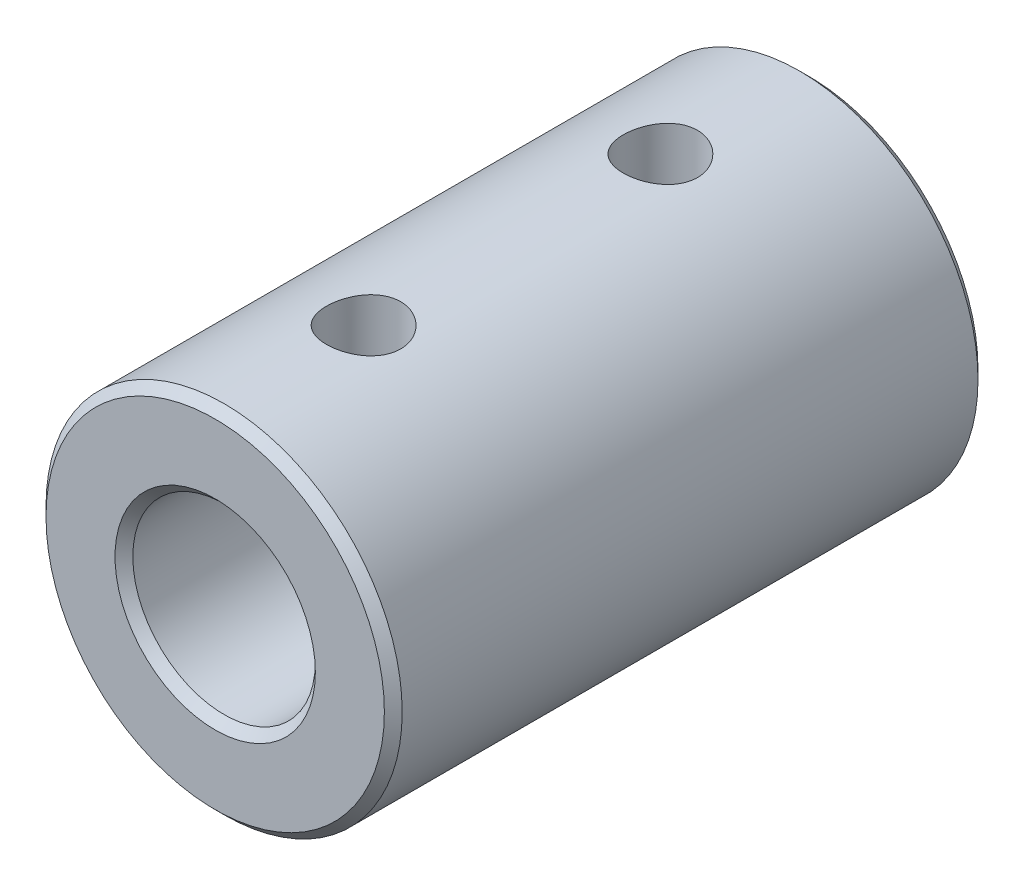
ISO-10303-21;
HEADER;
FILE_DESCRIPTION(('STEP AP214'),'2;1');
FILE_NAME('part.step','',(''),(''),'','','');
FILE_SCHEMA(('AUTOMOTIVE_DESIGN { 1 0 10303 214 1 1 1 1 }'));
ENDSEC;
DATA;
#1=APPLICATION_CONTEXT('core data for automotive mechanical design processes');
#2=APPLICATION_PROTOCOL_DEFINITION('international standard','automotive_design',2000,#1);
#3=PRODUCT_CONTEXT('',#1,'mechanical');
#4=PRODUCT('Part','Part','',(#3));
#5=PRODUCT_RELATED_PRODUCT_CATEGORY('part','',(#4));
#6=PRODUCT_DEFINITION_FORMATION('','',#4);
#7=PRODUCT_DEFINITION_CONTEXT('part definition',#1,'design');
#8=PRODUCT_DEFINITION('design','',#6,#7);
#9=PRODUCT_DEFINITION_SHAPE('','',#8);
#10=(LENGTH_UNIT() NAMED_UNIT(*) SI_UNIT(.MILLI.,.METRE.));
#11=(NAMED_UNIT(*) PLANE_ANGLE_UNIT() SI_UNIT($,.RADIAN.));
#12=(NAMED_UNIT(*) SI_UNIT($,.STERADIAN.) SOLID_ANGLE_UNIT());
#13=UNCERTAINTY_MEASURE_WITH_UNIT(LENGTH_MEASURE(1.E-05),#10,'distance_accuracy_value','');
#14=(GEOMETRIC_REPRESENTATION_CONTEXT(3) GLOBAL_UNCERTAINTY_ASSIGNED_CONTEXT((#13)) GLOBAL_UNIT_ASSIGNED_CONTEXT((#10,
#11,#12)) REPRESENTATION_CONTEXT('',''));
#15=CARTESIAN_POINT('',(0.,0.,0.));
#16=DIRECTION('',(0.,0.,1.));
#17=DIRECTION('',(1.,0.,0.));
#18=AXIS2_PLACEMENT_3D('',#15,#16,#17);
#19=CARTESIAN_POINT('',(0.,0.,10.));
#20=DIRECTION('',(0.,0.,1.));
#21=DIRECTION('',(1.,0.,0.));
#22=AXIS2_PLACEMENT_3D('',#19,#20,#21);
#23=PLANE('',#22);
#24=CARTESIAN_POINT('',(0.,0.,10.));
#25=DIRECTION('',(0.,0.,1.));
#26=DIRECTION('',(1.,0.,0.));
#27=AXIS2_PLACEMENT_3D('',#24,#25,#26);
#28=CIRCLE('',#27,5.7);
#29=CARTESIAN_POINT('',(-5.7,0.,10.));
#30=VERTEX_POINT('',#29);
#31=EDGE_CURVE('E10',#30,#30,#28,.T.);
#32=ORIENTED_EDGE('',*,*,#31,.T.);
#33=EDGE_LOOP('',(#32));
#34=FACE_BOUND('',#33,.T.);
#35=CARTESIAN_POINT('',(0.,0.,10.));
#36=DIRECTION('',(0.,0.,1.));
#37=DIRECTION('',(1.,0.,0.));
#38=AXIS2_PLACEMENT_3D('',#35,#36,#37);
#39=CIRCLE('',#38,3.37500000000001);
#40=CARTESIAN_POINT('',(3.37500000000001,0.,10.));
#41=VERTEX_POINT('',#40);
#42=EDGE_CURVE('E37',#41,#41,#39,.F.);
#43=ORIENTED_EDGE('',*,*,#42,.T.);
#44=EDGE_LOOP('',(#43));
#45=FACE_BOUND('',#44,.T.);
#46=ADVANCED_FACE('F30',(#34,#45),#23,.T.);
#47=CARTESIAN_POINT('',(0.,0.,-10.));
#48=DIRECTION('',(0.,0.,1.));
#49=DIRECTION('',(1.,0.,0.));
#50=AXIS2_PLACEMENT_3D('',#47,#48,#49);
#51=PLANE('',#50);
#52=CARTESIAN_POINT('',(0.,0.,-10.));
#53=DIRECTION('',(0.,0.,1.));
#54=DIRECTION('',(1.,0.,0.));
#55=AXIS2_PLACEMENT_3D('',#52,#53,#54);
#56=CIRCLE('',#55,3.375);
#57=CARTESIAN_POINT('',(3.375,0.,-10.));
#58=VERTEX_POINT('',#57);
#59=EDGE_CURVE('E56',#58,#58,#56,.T.);
#60=ORIENTED_EDGE('',*,*,#59,.T.);
#61=EDGE_LOOP('',(#60));
#62=FACE_BOUND('',#61,.T.);
#63=CARTESIAN_POINT('',(0.,0.,-10.));
#64=DIRECTION('',(0.,0.,1.));
#65=DIRECTION('',(1.,0.,0.));
#66=AXIS2_PLACEMENT_3D('',#63,#64,#65);
#67=CIRCLE('',#66,5.7);
#68=CARTESIAN_POINT('',(5.7,0.,-10.));
#69=VERTEX_POINT('',#68);
#70=EDGE_CURVE('E59',#69,#69,#67,.F.);
#71=ORIENTED_EDGE('',*,*,#70,.T.);
#72=EDGE_LOOP('',(#71));
#73=FACE_BOUND('',#72,.T.);
#74=ADVANCED_FACE('F105',(#62,#73),#51,.F.);
#75=CARTESIAN_POINT('',(0.,0.,10.));
#76=DIRECTION('',(0.,0.,-1.));
#77=DIRECTION('',(-1.,0.,0.));
#78=AXIS2_PLACEMENT_3D('',#75,#76,#77);
#79=CYLINDRICAL_SURFACE('',#78,6.);
#80=CARTESIAN_POINT('',(0.,0.,-9.7));
#81=DIRECTION('',(0.,0.,1.));
#82=DIRECTION('',(1.,0.,0.));
#83=AXIS2_PLACEMENT_3D('',#80,#81,#82);
#84=CIRCLE('',#83,6.);
#85=CARTESIAN_POINT('',(6.,0.,-9.7));
#86=VERTEX_POINT('',#85);
#87=EDGE_CURVE('E41',#86,#86,#84,.T.);
#88=ORIENTED_EDGE('',*,*,#87,.T.);
#89=EDGE_LOOP('',(#88));
#90=FACE_BOUND('',#89,.T.);
#91=CARTESIAN_POINT('',(0.,0.,9.7));
#92=DIRECTION('',(0.,0.,1.));
#93=DIRECTION('',(1.,0.,0.));
#94=AXIS2_PLACEMENT_3D('',#91,#92,#93);
#95=CIRCLE('',#94,6.);
#96=CARTESIAN_POINT('',(-6.,0.,9.7));
#97=VERTEX_POINT('',#96);
#98=EDGE_CURVE('E45',#97,#97,#95,.F.);
#99=ORIENTED_EDGE('',*,*,#98,.T.);
#100=EDGE_LOOP('',(#99));
#101=FACE_BOUND('',#100,.T.);
#102=CARTESIAN_POINT('',(0.,-6.,-3.75));
#103=CARTESIAN_POINT('',(0.0694090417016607,-5.99999871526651,-3.75000247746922));
#104=CARTESIAN_POINT('',(0.138848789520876,-5.99878328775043,-3.75580066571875));
#105=CARTESIAN_POINT('',(0.275761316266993,-5.9940520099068,-3.77881934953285));
#106=CARTESIAN_POINT('',(0.343232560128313,-5.99053441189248,-3.79604852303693));
#107=CARTESIAN_POINT('',(0.474209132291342,-5.98159109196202,-3.84137045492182));
#108=CARTESIAN_POINT('',(0.537718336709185,-5.97616727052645,-3.86945239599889));
#109=CARTESIAN_POINT('',(0.659120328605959,-5.96399927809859,-3.93564960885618));
#110=CARTESIAN_POINT('',(0.717013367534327,-5.95725516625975,-3.97376443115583));
#111=CARTESIAN_POINT('',(0.826390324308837,-5.9430770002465,-4.05953634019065));
#112=CARTESIAN_POINT('',(0.877780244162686,-5.93563505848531,-4.10731200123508));
#113=CARTESIAN_POINT('',(0.971877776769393,-5.92095657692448,-4.21079465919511));
#114=CARTESIAN_POINT('',(1.01458467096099,-5.91372005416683,-4.26650231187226));
#115=CARTESIAN_POINT('',(1.09051031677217,-5.90019442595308,-4.38495196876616));
#116=CARTESIAN_POINT('',(1.12363054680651,-5.89391545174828,-4.44775838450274));
#117=CARTESIAN_POINT('',(1.17881119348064,-5.8831284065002,-4.57819745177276));
#118=CARTESIAN_POINT('',(1.20087280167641,-5.87862014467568,-4.64582958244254));
#119=CARTESIAN_POINT('',(1.23300240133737,-5.87196500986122,-4.78298523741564));
#120=CARTESIAN_POINT('',(1.24323597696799,-5.86978556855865,-4.85246835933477));
#121=CARTESIAN_POINT('',(1.25193357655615,-5.86793690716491,-4.99219684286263));
#122=CARTESIAN_POINT('',(1.25039890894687,-5.86826740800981,-5.0624421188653));
#123=CARTESIAN_POINT('',(1.23573719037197,-5.87137174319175,-5.20048102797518));
#124=CARTESIAN_POINT('',(1.2228010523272,-5.87410533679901,-5.26829597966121));
#125=CARTESIAN_POINT('',(1.18600543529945,-5.88164437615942,-5.40077150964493));
#126=CARTESIAN_POINT('',(1.16214539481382,-5.88644992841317,-5.46543192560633));
#127=CARTESIAN_POINT('',(1.10400003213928,-5.89763191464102,-5.59030722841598));
#128=CARTESIAN_POINT('',(1.06964002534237,-5.90401953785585,-5.65048629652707));
#129=CARTESIAN_POINT('',(0.991522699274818,-5.91763890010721,-5.76429574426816));
#130=CARTESIAN_POINT('',(0.947764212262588,-5.92487074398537,-5.81792530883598));
#131=CARTESIAN_POINT('',(0.851074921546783,-5.93953730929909,-5.91821396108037));
#132=CARTESIAN_POINT('',(0.797981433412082,-5.94697323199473,-5.96471616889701));
#133=CARTESIAN_POINT('',(0.684667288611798,-5.96108088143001,-6.04818044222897));
#134=CARTESIAN_POINT('',(0.624446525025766,-5.96775259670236,-6.0851423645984));
#135=CARTESIAN_POINT('',(0.498405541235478,-5.97959870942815,-6.14851008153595));
#136=CARTESIAN_POINT('',(0.4325754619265,-5.98477039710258,-6.17489680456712));
#137=CARTESIAN_POINT('',(0.297284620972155,-5.99301338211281,-6.21619170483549));
#138=CARTESIAN_POINT('',(0.227824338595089,-5.99608495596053,-6.2311013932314));
#139=CARTESIAN_POINT('',(0.0885918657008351,-5.99974275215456,-6.24879425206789));
#140=CARTESIAN_POINT('',(0.0188480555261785,-6.00037293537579,-6.25179194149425));
#141=CARTESIAN_POINT('',(-0.120143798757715,-5.99919952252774,-6.2461550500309));
#142=CARTESIAN_POINT('',(-0.189391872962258,-5.99739607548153,-6.2375211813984));
#143=CARTESIAN_POINT('',(-0.324726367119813,-5.99158564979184,-6.20904434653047));
#144=CARTESIAN_POINT('',(-0.390837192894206,-5.98760052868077,-6.18931251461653));
#145=CARTESIAN_POINT('',(-0.518811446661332,-5.97787227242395,-6.13932213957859));
#146=CARTESIAN_POINT('',(-0.580674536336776,-5.97212899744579,-6.10906275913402));
#147=CARTESIAN_POINT('',(-0.699294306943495,-5.95941241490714,-6.03841962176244));
#148=CARTESIAN_POINT('',(-0.755973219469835,-5.9524239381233,-5.99790807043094));
#149=CARTESIAN_POINT('',(-0.861805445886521,-5.93802568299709,-5.90808043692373));
#150=CARTESIAN_POINT('',(-0.910957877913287,-5.93061585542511,-5.85876332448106));
#151=CARTESIAN_POINT('',(-1.0011786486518,-5.91606024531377,-5.7517444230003));
#152=CARTESIAN_POINT('',(-1.04209914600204,-5.90892089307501,-5.69391696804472));
#153=CARTESIAN_POINT('',(-1.11364719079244,-5.89585601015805,-5.57208371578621));
#154=CARTESIAN_POINT('',(-1.14427516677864,-5.88993042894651,-5.50807817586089));
#155=CARTESIAN_POINT('',(-1.19417246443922,-5.88001700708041,-5.37603880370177));
#156=CARTESIAN_POINT('',(-1.21350309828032,-5.87601872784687,-5.30802896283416));
#157=CARTESIAN_POINT('',(-1.24044038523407,-5.87039184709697,-5.16963344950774));
#158=CARTESIAN_POINT('',(-1.24804871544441,-5.86876290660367,-5.09924811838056));
#159=CARTESIAN_POINT('',(-1.25125926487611,-5.86807907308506,-4.95958659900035));
#160=CARTESIAN_POINT('',(-1.24709542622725,-5.86897402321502,-4.89031592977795));
#161=CARTESIAN_POINT('',(-1.22739905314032,-5.87312447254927,-4.75348599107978));
#162=CARTESIAN_POINT('',(-1.21186662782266,-5.87637994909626,-4.68592670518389));
#163=CARTESIAN_POINT('',(-1.16998217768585,-5.88486132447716,-4.55460222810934));
#164=CARTESIAN_POINT('',(-1.14366117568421,-5.8900815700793,-4.49082675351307));
#165=CARTESIAN_POINT('',(-1.08097457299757,-5.90190705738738,-4.36856122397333));
#166=CARTESIAN_POINT('',(-1.0446080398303,-5.9085124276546,-4.31007166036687));
#167=CARTESIAN_POINT('',(-0.962073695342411,-5.92251579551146,-4.19887837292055));
#168=CARTESIAN_POINT('',(-0.915737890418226,-5.92992613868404,-4.14630087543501));
#169=CARTESIAN_POINT('',(-0.814924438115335,-5.94461839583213,-4.04959050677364));
#170=CARTESIAN_POINT('',(-0.760444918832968,-5.9519002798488,-4.00545958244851));
#171=CARTESIAN_POINT('',(-0.644134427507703,-5.96561444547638,-3.92641142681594));
#172=CARTESIAN_POINT('',(-0.582225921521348,-5.97203596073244,-3.89160632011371));
#173=CARTESIAN_POINT('',(-0.453319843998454,-5.98319908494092,-3.83294977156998));
#174=CARTESIAN_POINT('',(-0.386326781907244,-5.98794216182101,-3.80908875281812));
#175=CARTESIAN_POINT('',(-0.266015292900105,-5.99432499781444,-3.77745972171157));
#176=CARTESIAN_POINT('',(-0.213367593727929,-5.99644035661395,-3.76718123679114));
#177=CARTESIAN_POINT('',(-0.107152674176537,-5.99927832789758,-3.75345054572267));
#178=CARTESIAN_POINT('',(-0.0535854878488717,-6.00000099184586,-3.74999808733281));
#179=CARTESIAN_POINT('',(0.,-6.,-3.75));
#180=B_SPLINE_CURVE_WITH_KNOTS('',3,(#102,#103,#104,#105,#106,#107,#108,#109,#110,#111,#112,
#113,#114,#115,#116,#117,#118,#119,#120,#121,#122,#123,#124,#125,#126,#127,#128,#129,#130,#131,
#132,#133,#134,#135,#136,#137,#138,#139,#140,#141,#142,#143,#144,#145,#146,#147,#148,#149,#150,
#151,#152,#153,#154,#155,#156,#157,#158,#159,#160,#161,#162,#163,#164,#165,#166,#167,#168,#169,
#170,#171,#172,#173,#174,#175,#176,#177,#178,#179),.UNSPECIFIED.,.T.,.F.,(4,2,2,2,2,2,2,2,2,2,2,
2,2,2,2,2,2,2,2,2,2,2,2,2,2,2,2,2,2,2,2,2,2,2,2,2,2,2,4),(0.,0.208031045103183,
0.416220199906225,0.624202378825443,0.83217524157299,1.04287526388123,1.25359271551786,
1.46640449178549,1.6791933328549,1.88896575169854,2.09871484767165,2.3050171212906,
2.5113300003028,2.71914592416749,2.92698768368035,3.13889526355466,3.35080602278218,
3.56309724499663,3.77536051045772,3.98378339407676,4.19219351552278,4.39855286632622,
4.60492863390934,4.81401583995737,5.02312752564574,5.23571263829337,5.4482888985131,
5.65970050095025,5.87108185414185,6.07829223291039,6.28550062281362,6.49211731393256,
6.6987531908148,6.9091902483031,7.1196757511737,7.33258864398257,7.54531486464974,
7.70592588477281,7.86653096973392),.UNSPECIFIED.);
#181=CARTESIAN_POINT('',(0.,-6.,-3.75));
#182=VERTEX_POINT('',#181);
#183=EDGE_CURVE('E96',#182,#182,#180,.T.);
#184=ORIENTED_EDGE('',*,*,#183,.T.);
#185=EDGE_LOOP('',(#184));
#186=FACE_BOUND('',#185,.T.);
#187=CARTESIAN_POINT('',(0.,6.,-3.75));
#188=CARTESIAN_POINT('',(-0.0694090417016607,5.99999871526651,-3.75000247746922));
#189=CARTESIAN_POINT('',(-0.138848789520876,5.99878328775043,-3.75580066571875));
#190=CARTESIAN_POINT('',(-0.275761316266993,5.9940520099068,-3.77881934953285));
#191=CARTESIAN_POINT('',(-0.343232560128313,5.99053441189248,-3.79604852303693));
#192=CARTESIAN_POINT('',(-0.474209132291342,5.98159109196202,-3.84137045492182));
#193=CARTESIAN_POINT('',(-0.537718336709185,5.97616727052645,-3.86945239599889));
#194=CARTESIAN_POINT('',(-0.659120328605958,5.96399927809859,-3.93564960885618));
#195=CARTESIAN_POINT('',(-0.717013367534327,5.95725516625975,-3.97376443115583));
#196=CARTESIAN_POINT('',(-0.826390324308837,5.9430770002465,-4.05953634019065));
#197=CARTESIAN_POINT('',(-0.877780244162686,5.93563505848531,-4.10731200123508));
#198=CARTESIAN_POINT('',(-0.971877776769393,5.92095657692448,-4.21079465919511));
#199=CARTESIAN_POINT('',(-1.01458467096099,5.91372005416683,-4.26650231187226));
#200=CARTESIAN_POINT('',(-1.09051031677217,5.90019442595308,-4.38495196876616));
#201=CARTESIAN_POINT('',(-1.12363054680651,5.89391545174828,-4.44775838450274));
#202=CARTESIAN_POINT('',(-1.17881119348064,5.8831284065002,-4.57819745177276));
#203=CARTESIAN_POINT('',(-1.20087280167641,5.87862014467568,-4.64582958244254));
#204=CARTESIAN_POINT('',(-1.23300240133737,5.87196500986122,-4.78298523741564));
#205=CARTESIAN_POINT('',(-1.24323597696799,5.86978556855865,-4.85246835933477));
#206=CARTESIAN_POINT('',(-1.25193357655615,5.86793690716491,-4.99219684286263));
#207=CARTESIAN_POINT('',(-1.25039890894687,5.86826740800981,-5.0624421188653));
#208=CARTESIAN_POINT('',(-1.23573719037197,5.87137174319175,-5.20048102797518));
#209=CARTESIAN_POINT('',(-1.2228010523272,5.87410533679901,-5.26829597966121));
#210=CARTESIAN_POINT('',(-1.18600543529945,5.88164437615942,-5.40077150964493));
#211=CARTESIAN_POINT('',(-1.16214539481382,5.88644992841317,-5.46543192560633));
#212=CARTESIAN_POINT('',(-1.10400003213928,5.89763191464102,-5.59030722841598));
#213=CARTESIAN_POINT('',(-1.06964002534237,5.90401953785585,-5.65048629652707));
#214=CARTESIAN_POINT('',(-0.991522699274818,5.91763890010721,-5.76429574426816));
#215=CARTESIAN_POINT('',(-0.947764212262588,5.92487074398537,-5.81792530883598));
#216=CARTESIAN_POINT('',(-0.851074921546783,5.93953730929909,-5.91821396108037));
#217=CARTESIAN_POINT('',(-0.797981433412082,5.94697323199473,-5.96471616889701));
#218=CARTESIAN_POINT('',(-0.684667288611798,5.96108088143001,-6.04818044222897));
#219=CARTESIAN_POINT('',(-0.624446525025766,5.96775259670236,-6.0851423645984));
#220=CARTESIAN_POINT('',(-0.498405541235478,5.97959870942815,-6.14851008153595));
#221=CARTESIAN_POINT('',(-0.4325754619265,5.98477039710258,-6.17489680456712));
#222=CARTESIAN_POINT('',(-0.297284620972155,5.99301338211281,-6.21619170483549));
#223=CARTESIAN_POINT('',(-0.227824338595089,5.99608495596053,-6.2311013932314));
#224=CARTESIAN_POINT('',(-0.0885918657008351,5.99974275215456,-6.24879425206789));
#225=CARTESIAN_POINT('',(-0.0188480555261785,6.00037293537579,-6.25179194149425));
#226=CARTESIAN_POINT('',(0.120143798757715,5.99919952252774,-6.2461550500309));
#227=CARTESIAN_POINT('',(0.189391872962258,5.99739607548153,-6.2375211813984));
#228=CARTESIAN_POINT('',(0.324726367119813,5.99158564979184,-6.20904434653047));
#229=CARTESIAN_POINT('',(0.390837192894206,5.98760052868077,-6.18931251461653));
#230=CARTESIAN_POINT('',(0.518811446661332,5.97787227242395,-6.13932213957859));
#231=CARTESIAN_POINT('',(0.580674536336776,5.97212899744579,-6.10906275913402));
#232=CARTESIAN_POINT('',(0.699294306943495,5.95941241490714,-6.03841962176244));
#233=CARTESIAN_POINT('',(0.755973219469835,5.9524239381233,-5.99790807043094));
#234=CARTESIAN_POINT('',(0.861805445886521,5.93802568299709,-5.90808043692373));
#235=CARTESIAN_POINT('',(0.910957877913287,5.93061585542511,-5.85876332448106));
#236=CARTESIAN_POINT('',(1.0011786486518,5.91606024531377,-5.7517444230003));
#237=CARTESIAN_POINT('',(1.04209914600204,5.90892089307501,-5.69391696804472));
#238=CARTESIAN_POINT('',(1.11364719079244,5.89585601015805,-5.57208371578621));
#239=CARTESIAN_POINT('',(1.14427516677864,5.88993042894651,-5.50807817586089));
#240=CARTESIAN_POINT('',(1.19417246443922,5.88001700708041,-5.37603880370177));
#241=CARTESIAN_POINT('',(1.21350309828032,5.87601872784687,-5.30802896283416));
#242=CARTESIAN_POINT('',(1.24044038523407,5.87039184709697,-5.16963344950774));
#243=CARTESIAN_POINT('',(1.24804871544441,5.86876290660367,-5.09924811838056));
#244=CARTESIAN_POINT('',(1.25125926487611,5.86807907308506,-4.95958659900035));
#245=CARTESIAN_POINT('',(1.24709542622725,5.86897402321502,-4.89031592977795));
#246=CARTESIAN_POINT('',(1.22739905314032,5.87312447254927,-4.75348599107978));
#247=CARTESIAN_POINT('',(1.21186662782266,5.87637994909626,-4.68592670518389));
#248=CARTESIAN_POINT('',(1.16998217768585,5.88486132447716,-4.55460222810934));
#249=CARTESIAN_POINT('',(1.14366117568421,5.8900815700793,-4.49082675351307));
#250=CARTESIAN_POINT('',(1.08097457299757,5.90190705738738,-4.36856122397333));
#251=CARTESIAN_POINT('',(1.0446080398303,5.9085124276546,-4.31007166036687));
#252=CARTESIAN_POINT('',(0.962073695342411,5.92251579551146,-4.19887837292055));
#253=CARTESIAN_POINT('',(0.915737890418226,5.92992613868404,-4.14630087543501));
#254=CARTESIAN_POINT('',(0.814924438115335,5.94461839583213,-4.04959050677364));
#255=CARTESIAN_POINT('',(0.760444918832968,5.9519002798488,-4.00545958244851));
#256=CARTESIAN_POINT('',(0.644134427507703,5.96561444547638,-3.92641142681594));
#257=CARTESIAN_POINT('',(0.582225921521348,5.97203596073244,-3.89160632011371));
#258=CARTESIAN_POINT('',(0.453319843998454,5.98319908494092,-3.83294977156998));
#259=CARTESIAN_POINT('',(0.386326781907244,5.98794216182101,-3.80908875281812));
#260=CARTESIAN_POINT('',(0.266015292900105,5.99432499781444,-3.77745972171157));
#261=CARTESIAN_POINT('',(0.213367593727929,5.99644035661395,-3.76718123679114));
#262=CARTESIAN_POINT('',(0.107152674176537,5.99927832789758,-3.75345054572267));
#263=CARTESIAN_POINT('',(0.0535854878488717,6.00000099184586,-3.74999808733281));
#264=CARTESIAN_POINT('',(0.,6.,-3.75));
#265=B_SPLINE_CURVE_WITH_KNOTS('',3,(#187,#188,#189,#190,#191,#192,#193,#194,#195,#196,#197,
#198,#199,#200,#201,#202,#203,#204,#205,#206,#207,#208,#209,#210,#211,#212,#213,#214,#215,#216,
#217,#218,#219,#220,#221,#222,#223,#224,#225,#226,#227,#228,#229,#230,#231,#232,#233,#234,#235,
#236,#237,#238,#239,#240,#241,#242,#243,#244,#245,#246,#247,#248,#249,#250,#251,#252,#253,#254,
#255,#256,#257,#258,#259,#260,#261,#262,#263,#264),.UNSPECIFIED.,.T.,.F.,(4,2,2,2,2,2,2,2,2,2,2,
2,2,2,2,2,2,2,2,2,2,2,2,2,2,2,2,2,2,2,2,2,2,2,2,2,2,2,4),(0.,0.208031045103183,
0.416220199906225,0.624202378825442,0.83217524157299,1.04287526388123,1.25359271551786,
1.46640449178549,1.6791933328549,1.88896575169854,2.09871484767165,2.3050171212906,
2.5113300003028,2.71914592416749,2.92698768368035,3.13889526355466,3.35080602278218,
3.56309724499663,3.77536051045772,3.98378339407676,4.19219351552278,4.39855286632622,
4.60492863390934,4.81401583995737,5.02312752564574,5.23571263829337,5.4482888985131,
5.65970050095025,5.87108185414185,6.07829223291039,6.28550062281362,6.49211731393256,
6.6987531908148,6.9091902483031,7.1196757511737,7.33258864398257,7.54531486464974,
7.70592588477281,7.86653096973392),.UNSPECIFIED.);
#266=CARTESIAN_POINT('',(0.,6.,-3.75));
#267=VERTEX_POINT('',#266);
#268=EDGE_CURVE('E70',#267,#267,#265,.T.);
#269=ORIENTED_EDGE('',*,*,#268,.T.);
#270=EDGE_LOOP('',(#269));
#271=FACE_BOUND('',#270,.T.);
#272=CARTESIAN_POINT('',(0.,-6.,6.25));
#273=CARTESIAN_POINT('',(0.0694090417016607,-5.99999871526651,6.24999752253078));
#274=CARTESIAN_POINT('',(0.138848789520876,-5.99878328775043,6.24419933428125));
#275=CARTESIAN_POINT('',(0.275761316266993,-5.9940520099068,6.22118065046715));
#276=CARTESIAN_POINT('',(0.343232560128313,-5.99053441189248,6.20395147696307));
#277=CARTESIAN_POINT('',(0.474209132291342,-5.98159109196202,6.15862954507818));
#278=CARTESIAN_POINT('',(0.537718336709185,-5.97616727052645,6.13054760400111));
#279=CARTESIAN_POINT('',(0.659120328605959,-5.96399927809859,6.06435039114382));
#280=CARTESIAN_POINT('',(0.717013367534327,-5.95725516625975,6.02623556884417));
#281=CARTESIAN_POINT('',(0.826390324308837,-5.9430770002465,5.94046365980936));
#282=CARTESIAN_POINT('',(0.877780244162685,-5.93563505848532,5.89268799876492));
#283=CARTESIAN_POINT('',(0.971877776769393,-5.92095657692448,5.78920534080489));
#284=CARTESIAN_POINT('',(1.01458467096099,-5.91372005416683,5.73349768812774));
#285=CARTESIAN_POINT('',(1.09051031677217,-5.90019442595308,5.61504803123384));
#286=CARTESIAN_POINT('',(1.12363054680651,-5.89391545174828,5.55224161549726));
#287=CARTESIAN_POINT('',(1.17881119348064,-5.8831284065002,5.42180254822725));
#288=CARTESIAN_POINT('',(1.20087280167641,-5.87862014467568,5.35417041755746));
#289=CARTESIAN_POINT('',(1.23300240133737,-5.87196500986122,5.21701476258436));
#290=CARTESIAN_POINT('',(1.24323597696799,-5.86978556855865,5.14753164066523));
#291=CARTESIAN_POINT('',(1.25193357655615,-5.86793690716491,5.00780315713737));
#292=CARTESIAN_POINT('',(1.25039890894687,-5.86826740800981,4.9375578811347));
#293=CARTESIAN_POINT('',(1.23573719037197,-5.87137174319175,4.79951897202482));
#294=CARTESIAN_POINT('',(1.2228010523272,-5.87410533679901,4.73170402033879));
#295=CARTESIAN_POINT('',(1.18600543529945,-5.88164437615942,4.59922849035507));
#296=CARTESIAN_POINT('',(1.16214539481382,-5.88644992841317,4.53456807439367));
#297=CARTESIAN_POINT('',(1.10400003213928,-5.89763191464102,4.40969277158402));
#298=CARTESIAN_POINT('',(1.06964002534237,-5.90401953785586,4.34951370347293));
#299=CARTESIAN_POINT('',(0.991522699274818,-5.91763890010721,4.23570425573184));
#300=CARTESIAN_POINT('',(0.947764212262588,-5.92487074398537,4.18207469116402));
#301=CARTESIAN_POINT('',(0.851074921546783,-5.93953730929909,4.08178603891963));
#302=CARTESIAN_POINT('',(0.797981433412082,-5.94697323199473,4.03528383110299));
#303=CARTESIAN_POINT('',(0.684667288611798,-5.96108088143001,3.95181955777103));
#304=CARTESIAN_POINT('',(0.624446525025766,-5.96775259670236,3.9148576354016));
#305=CARTESIAN_POINT('',(0.498405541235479,-5.97959870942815,3.85148991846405));
#306=CARTESIAN_POINT('',(0.4325754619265,-5.98477039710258,3.82510319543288));
#307=CARTESIAN_POINT('',(0.297284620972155,-5.99301338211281,3.78380829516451));
#308=CARTESIAN_POINT('',(0.22782433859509,-5.99608495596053,3.7688986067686));
#309=CARTESIAN_POINT('',(0.0885918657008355,-5.99974275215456,3.75120574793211));
#310=CARTESIAN_POINT('',(0.0188480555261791,-6.00037293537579,3.74820805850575));
#311=CARTESIAN_POINT('',(-0.120143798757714,-5.99919952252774,3.7538449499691));
#312=CARTESIAN_POINT('',(-0.189391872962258,-5.99739607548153,3.7624788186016));
#313=CARTESIAN_POINT('',(-0.324726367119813,-5.99158564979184,3.79095565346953));
#314=CARTESIAN_POINT('',(-0.390837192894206,-5.98760052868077,3.81068748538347));
#315=CARTESIAN_POINT('',(-0.518811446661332,-5.97787227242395,3.86067786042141));
#316=CARTESIAN_POINT('',(-0.580674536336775,-5.97212899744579,3.89093724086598));
#317=CARTESIAN_POINT('',(-0.699294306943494,-5.95941241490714,3.96158037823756));
#318=CARTESIAN_POINT('',(-0.755973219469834,-5.9524239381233,4.00209192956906));
#319=CARTESIAN_POINT('',(-0.86180544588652,-5.93802568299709,4.09191956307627));
#320=CARTESIAN_POINT('',(-0.910957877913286,-5.93061585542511,4.14123667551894));
#321=CARTESIAN_POINT('',(-1.0011786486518,-5.91606024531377,4.2482555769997));
#322=CARTESIAN_POINT('',(-1.04209914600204,-5.90892089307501,4.30608303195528));
#323=CARTESIAN_POINT('',(-1.11364719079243,-5.89585601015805,4.42791628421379));
#324=CARTESIAN_POINT('',(-1.14427516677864,-5.88993042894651,4.49192182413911));
#325=CARTESIAN_POINT('',(-1.19417246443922,-5.88001700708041,4.62396119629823));
#326=CARTESIAN_POINT('',(-1.21350309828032,-5.87601872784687,4.69197103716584));
#327=CARTESIAN_POINT('',(-1.24044038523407,-5.87039184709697,4.83036655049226));
#328=CARTESIAN_POINT('',(-1.24804871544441,-5.86876290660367,4.90075188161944));
#329=CARTESIAN_POINT('',(-1.25125926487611,-5.86807907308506,5.04041340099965));
#330=CARTESIAN_POINT('',(-1.24709542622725,-5.86897402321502,5.10968407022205));
#331=CARTESIAN_POINT('',(-1.22739905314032,-5.87312447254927,5.24651400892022));
#332=CARTESIAN_POINT('',(-1.21186662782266,-5.87637994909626,5.31407329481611));
#333=CARTESIAN_POINT('',(-1.16998217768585,-5.88486132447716,5.44539777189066));
#334=CARTESIAN_POINT('',(-1.14366117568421,-5.8900815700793,5.50917324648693));
#335=CARTESIAN_POINT('',(-1.08097457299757,-5.90190705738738,5.63143877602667));
#336=CARTESIAN_POINT('',(-1.0446080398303,-5.9085124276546,5.68992833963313));
#337=CARTESIAN_POINT('',(-0.962073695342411,-5.92251579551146,5.80112162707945));
#338=CARTESIAN_POINT('',(-0.915737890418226,-5.92992613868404,5.85369912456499));
#339=CARTESIAN_POINT('',(-0.814924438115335,-5.94461839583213,5.95040949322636));
#340=CARTESIAN_POINT('',(-0.760444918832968,-5.9519002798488,5.99454041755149));
#341=CARTESIAN_POINT('',(-0.644134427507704,-5.96561444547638,6.07358857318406));
#342=CARTESIAN_POINT('',(-0.582225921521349,-5.97203596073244,6.10839367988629));
#343=CARTESIAN_POINT('',(-0.453319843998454,-5.98319908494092,6.16705022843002));
#344=CARTESIAN_POINT('',(-0.386326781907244,-5.98794216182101,6.19091124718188));
#345=CARTESIAN_POINT('',(-0.266015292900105,-5.99432499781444,6.22254027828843));
#346=CARTESIAN_POINT('',(-0.213367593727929,-5.99644035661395,6.23281876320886));
#347=CARTESIAN_POINT('',(-0.107152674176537,-5.99927832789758,6.24654945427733));
#348=CARTESIAN_POINT('',(-0.0535854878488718,-6.00000099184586,6.25000191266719));
#349=CARTESIAN_POINT('',(0.,-6.,6.25));
#350=B_SPLINE_CURVE_WITH_KNOTS('',3,(#272,#273,#274,#275,#276,#277,#278,#279,#280,#281,#282,
#283,#284,#285,#286,#287,#288,#289,#290,#291,#292,#293,#294,#295,#296,#297,#298,#299,#300,#301,
#302,#303,#304,#305,#306,#307,#308,#309,#310,#311,#312,#313,#314,#315,#316,#317,#318,#319,#320,
#321,#322,#323,#324,#325,#326,#327,#328,#329,#330,#331,#332,#333,#334,#335,#336,#337,#338,#339,
#340,#341,#342,#343,#344,#345,#346,#347,#348,#349),.UNSPECIFIED.,.T.,.F.,(4,2,2,2,2,2,2,2,2,2,2,
2,2,2,2,2,2,2,2,2,2,2,2,2,2,2,2,2,2,2,2,2,2,2,2,2,2,2,4),(0.,0.208031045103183,
0.416220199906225,0.624202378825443,0.83217524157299,1.04287526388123,1.25359271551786,
1.46640449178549,1.6791933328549,1.88896575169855,2.09871484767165,2.3050171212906,
2.5113300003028,2.71914592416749,2.92698768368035,3.13889526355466,3.35080602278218,
3.56309724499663,3.77536051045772,3.98378339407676,4.19219351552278,4.39855286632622,
4.60492863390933,4.81401583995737,5.02312752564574,5.23571263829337,5.44828889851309,
5.65970050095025,5.87108185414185,6.07829223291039,6.28550062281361,6.49211731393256,
6.6987531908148,6.90919024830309,7.1196757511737,7.33258864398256,7.54531486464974,
7.7059258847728,7.86653096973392),.UNSPECIFIED.);
#351=CARTESIAN_POINT('',(0.,-6.,6.25));
#352=VERTEX_POINT('',#351);
#353=EDGE_CURVE('E62',#352,#352,#350,.T.);
#354=ORIENTED_EDGE('',*,*,#353,.T.);
#355=EDGE_LOOP('',(#354));
#356=FACE_BOUND('',#355,.T.);
#357=CARTESIAN_POINT('',(0.,6.,6.25));
#358=CARTESIAN_POINT('',(-0.0694090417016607,5.99999871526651,6.24999752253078));
#359=CARTESIAN_POINT('',(-0.138848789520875,5.99878328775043,6.24419933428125));
#360=CARTESIAN_POINT('',(-0.275761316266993,5.9940520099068,6.22118065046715));
#361=CARTESIAN_POINT('',(-0.343232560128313,5.99053441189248,6.20395147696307));
#362=CARTESIAN_POINT('',(-0.474209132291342,5.98159109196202,6.15862954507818));
#363=CARTESIAN_POINT('',(-0.537718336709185,5.97616727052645,6.13054760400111));
#364=CARTESIAN_POINT('',(-0.659120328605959,5.96399927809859,6.06435039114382));
#365=CARTESIAN_POINT('',(-0.717013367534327,5.95725516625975,6.02623556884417));
#366=CARTESIAN_POINT('',(-0.826390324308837,5.9430770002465,5.94046365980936));
#367=CARTESIAN_POINT('',(-0.877780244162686,5.93563505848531,5.89268799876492));
#368=CARTESIAN_POINT('',(-0.971877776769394,5.92095657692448,5.78920534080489));
#369=CARTESIAN_POINT('',(-1.01458467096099,5.91372005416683,5.73349768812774));
#370=CARTESIAN_POINT('',(-1.09051031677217,5.90019442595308,5.61504803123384));
#371=CARTESIAN_POINT('',(-1.12363054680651,5.89391545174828,5.55224161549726));
#372=CARTESIAN_POINT('',(-1.17881119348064,5.8831284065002,5.42180254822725));
#373=CARTESIAN_POINT('',(-1.20087280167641,5.87862014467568,5.35417041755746));
#374=CARTESIAN_POINT('',(-1.23300240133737,5.87196500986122,5.21701476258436));
#375=CARTESIAN_POINT('',(-1.24323597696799,5.86978556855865,5.14753164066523));
#376=CARTESIAN_POINT('',(-1.25193357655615,5.86793690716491,5.00780315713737));
#377=CARTESIAN_POINT('',(-1.25039890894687,5.86826740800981,4.9375578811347));
#378=CARTESIAN_POINT('',(-1.23573719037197,5.87137174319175,4.79951897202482));
#379=CARTESIAN_POINT('',(-1.2228010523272,5.87410533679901,4.73170402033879));
#380=CARTESIAN_POINT('',(-1.18600543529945,5.88164437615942,4.59922849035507));
#381=CARTESIAN_POINT('',(-1.16214539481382,5.88644992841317,4.53456807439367));
#382=CARTESIAN_POINT('',(-1.10400003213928,5.89763191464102,4.40969277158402));
#383=CARTESIAN_POINT('',(-1.06964002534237,5.90401953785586,4.34951370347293));
#384=CARTESIAN_POINT('',(-0.991522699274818,5.91763890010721,4.23570425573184));
#385=CARTESIAN_POINT('',(-0.947764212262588,5.92487074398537,4.18207469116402));
#386=CARTESIAN_POINT('',(-0.851074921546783,5.93953730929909,4.08178603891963));
#387=CARTESIAN_POINT('',(-0.797981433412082,5.94697323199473,4.03528383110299));
#388=CARTESIAN_POINT('',(-0.684667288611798,5.96108088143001,3.95181955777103));
#389=CARTESIAN_POINT('',(-0.624446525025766,5.96775259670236,3.9148576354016));
#390=CARTESIAN_POINT('',(-0.498405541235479,5.97959870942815,3.85148991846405));
#391=CARTESIAN_POINT('',(-0.4325754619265,5.98477039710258,3.82510319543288));
#392=CARTESIAN_POINT('',(-0.297284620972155,5.99301338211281,3.78380829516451));
#393=CARTESIAN_POINT('',(-0.22782433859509,5.99608495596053,3.7688986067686));
#394=CARTESIAN_POINT('',(-0.0885918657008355,5.99974275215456,3.75120574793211));
#395=CARTESIAN_POINT('',(-0.0188480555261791,6.00037293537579,3.74820805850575));
#396=CARTESIAN_POINT('',(0.120143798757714,5.99919952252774,3.7538449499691));
#397=CARTESIAN_POINT('',(0.189391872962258,5.99739607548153,3.7624788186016));
#398=CARTESIAN_POINT('',(0.324726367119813,5.99158564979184,3.79095565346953));
#399=CARTESIAN_POINT('',(0.390837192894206,5.98760052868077,3.81068748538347));
#400=CARTESIAN_POINT('',(0.518811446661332,5.97787227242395,3.86067786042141));
#401=CARTESIAN_POINT('',(0.580674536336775,5.97212899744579,3.89093724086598));
#402=CARTESIAN_POINT('',(0.699294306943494,5.95941241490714,3.96158037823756));
#403=CARTESIAN_POINT('',(0.755973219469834,5.9524239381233,4.00209192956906));
#404=CARTESIAN_POINT('',(0.86180544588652,5.93802568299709,4.09191956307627));
#405=CARTESIAN_POINT('',(0.910957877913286,5.93061585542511,4.14123667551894));
#406=CARTESIAN_POINT('',(1.0011786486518,5.91606024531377,4.2482555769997));
#407=CARTESIAN_POINT('',(1.04209914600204,5.90892089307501,4.30608303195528));
#408=CARTESIAN_POINT('',(1.11364719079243,5.89585601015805,4.42791628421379));
#409=CARTESIAN_POINT('',(1.14427516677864,5.88993042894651,4.49192182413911));
#410=CARTESIAN_POINT('',(1.19417246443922,5.88001700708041,4.62396119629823));
#411=CARTESIAN_POINT('',(1.21350309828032,5.87601872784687,4.69197103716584));
#412=CARTESIAN_POINT('',(1.24044038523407,5.87039184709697,4.83036655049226));
#413=CARTESIAN_POINT('',(1.24804871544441,5.86876290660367,4.90075188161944));
#414=CARTESIAN_POINT('',(1.25125926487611,5.86807907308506,5.04041340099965));
#415=CARTESIAN_POINT('',(1.24709542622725,5.86897402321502,5.10968407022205));
#416=CARTESIAN_POINT('',(1.22739905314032,5.87312447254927,5.24651400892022));
#417=CARTESIAN_POINT('',(1.21186662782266,5.87637994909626,5.31407329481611));
#418=CARTESIAN_POINT('',(1.16998217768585,5.88486132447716,5.44539777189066));
#419=CARTESIAN_POINT('',(1.14366117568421,5.8900815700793,5.50917324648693));
#420=CARTESIAN_POINT('',(1.08097457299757,5.90190705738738,5.63143877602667));
#421=CARTESIAN_POINT('',(1.0446080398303,5.9085124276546,5.68992833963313));
#422=CARTESIAN_POINT('',(0.962073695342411,5.92251579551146,5.80112162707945));
#423=CARTESIAN_POINT('',(0.915737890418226,5.92992613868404,5.85369912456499));
#424=CARTESIAN_POINT('',(0.814924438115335,5.94461839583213,5.95040949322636));
#425=CARTESIAN_POINT('',(0.760444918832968,5.9519002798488,5.99454041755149));
#426=CARTESIAN_POINT('',(0.644134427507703,5.96561444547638,6.07358857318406));
#427=CARTESIAN_POINT('',(0.582225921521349,5.97203596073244,6.10839367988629));
#428=CARTESIAN_POINT('',(0.453319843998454,5.98319908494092,6.16705022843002));
#429=CARTESIAN_POINT('',(0.386326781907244,5.98794216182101,6.19091124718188));
#430=CARTESIAN_POINT('',(0.266015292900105,5.99432499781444,6.22254027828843));
#431=CARTESIAN_POINT('',(0.213367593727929,5.99644035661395,6.23281876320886));
#432=CARTESIAN_POINT('',(0.107152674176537,5.99927832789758,6.24654945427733));
#433=CARTESIAN_POINT('',(0.0535854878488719,6.00000099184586,6.25000191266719));
#434=CARTESIAN_POINT('',(0.,6.,6.25));
#435=B_SPLINE_CURVE_WITH_KNOTS('',3,(#357,#358,#359,#360,#361,#362,#363,#364,#365,#366,#367,
#368,#369,#370,#371,#372,#373,#374,#375,#376,#377,#378,#379,#380,#381,#382,#383,#384,#385,#386,
#387,#388,#389,#390,#391,#392,#393,#394,#395,#396,#397,#398,#399,#400,#401,#402,#403,#404,#405,
#406,#407,#408,#409,#410,#411,#412,#413,#414,#415,#416,#417,#418,#419,#420,#421,#422,#423,#424,
#425,#426,#427,#428,#429,#430,#431,#432,#433,#434),.UNSPECIFIED.,.T.,.F.,(4,2,2,2,2,2,2,2,2,2,2,
2,2,2,2,2,2,2,2,2,2,2,2,2,2,2,2,2,2,2,2,2,2,2,2,2,2,2,4),(0.,0.208031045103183,
0.416220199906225,0.624202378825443,0.83217524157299,1.04287526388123,1.25359271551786,
1.46640449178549,1.6791933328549,1.88896575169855,2.09871484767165,2.3050171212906,
2.5113300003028,2.71914592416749,2.92698768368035,3.13889526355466,3.35080602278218,
3.56309724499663,3.77536051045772,3.98378339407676,4.19219351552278,4.39855286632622,
4.60492863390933,4.81401583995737,5.02312752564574,5.23571263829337,5.44828889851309,
5.65970050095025,5.87108185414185,6.07829223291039,6.28550062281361,6.49211731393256,
6.6987531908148,6.90919024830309,7.1196757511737,7.33258864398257,7.54531486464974,
7.7059258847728,7.86653096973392),.UNSPECIFIED.);
#436=CARTESIAN_POINT('',(0.,6.,6.25));
#437=VERTEX_POINT('',#436);
#438=EDGE_CURVE('E110',#437,#437,#435,.T.);
#439=ORIENTED_EDGE('',*,*,#438,.T.);
#440=EDGE_LOOP('',(#439));
#441=FACE_BOUND('',#440,.T.);
#442=ADVANCED_FACE('F100',(#90,#101,#186,#271,#356,#441),#79,.T.);
#443=CARTESIAN_POINT('',(0.,0.,10.));
#444=DIRECTION('',(0.,0.,-1.));
#445=DIRECTION('',(-1.,0.,0.));
#446=AXIS2_PLACEMENT_3D('',#443,#444,#445);
#447=CYLINDRICAL_SURFACE('',#446,3.075);
#448=CARTESIAN_POINT('',(0.,0.,-9.7));
#449=DIRECTION('',(0.,0.,1.));
#450=DIRECTION('',(1.,0.,0.));
#451=AXIS2_PLACEMENT_3D('',#448,#449,#450);
#452=CIRCLE('',#451,3.075);
#453=CARTESIAN_POINT('',(3.075,0.,-9.7));
#454=VERTEX_POINT('',#453);
#455=EDGE_CURVE('E50',#454,#454,#452,.F.);
#456=ORIENTED_EDGE('',*,*,#455,.T.);
#457=EDGE_LOOP('',(#456));
#458=FACE_BOUND('',#457,.T.);
#459=CARTESIAN_POINT('',(0.,0.,9.7));
#460=DIRECTION('',(0.,0.,1.));
#461=DIRECTION('',(1.,0.,0.));
#462=AXIS2_PLACEMENT_3D('',#459,#460,#461);
#463=CIRCLE('',#462,3.075);
#464=CARTESIAN_POINT('',(3.075,0.,9.7));
#465=VERTEX_POINT('',#464);
#466=EDGE_CURVE('E53',#465,#465,#463,.T.);
#467=ORIENTED_EDGE('',*,*,#466,.T.);
#468=EDGE_LOOP('',(#467));
#469=FACE_BOUND('',#468,.T.);
#470=CARTESIAN_POINT('',(0.,-3.075,-3.75));
#471=CARTESIAN_POINT('',(0.0670960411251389,-3.07499507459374,-3.75000661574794));
#472=CARTESIAN_POINT('',(0.134304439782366,-3.07277831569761,-3.75543443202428));
#473=CARTESIAN_POINT('',(0.266822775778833,-3.06412620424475,-3.77695598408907));
#474=CARTESIAN_POINT('',(0.332127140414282,-3.05767955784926,-3.79307827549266));
#475=CARTESIAN_POINT('',(0.458705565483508,-3.04126163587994,-3.83530124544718));
#476=CARTESIAN_POINT('',(0.51999221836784,-3.03130206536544,-3.86136880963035));
#477=CARTESIAN_POINT('',(0.637265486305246,-3.00883490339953,-3.92260894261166));
#478=CARTESIAN_POINT('',(0.693253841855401,-2.99632815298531,-3.95777850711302));
#479=CARTESIAN_POINT('',(0.801130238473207,-2.969350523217,-4.03801975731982));
#480=CARTESIAN_POINT('',(0.85272874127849,-2.95481736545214,-4.08345959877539));
#481=CARTESIAN_POINT('',(0.947819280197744,-2.92570360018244,-4.182173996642));
#482=CARTESIAN_POINT('',(0.991307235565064,-2.91112297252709,-4.23545247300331));
#483=CARTESIAN_POINT('',(1.07092779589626,-2.88281270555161,-4.35132547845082));
#484=CARTESIAN_POINT('',(1.10662661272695,-2.8691537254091,-4.41423713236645));
#485=CARTESIAN_POINT('',(1.16680627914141,-2.84521438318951,-4.54580955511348));
#486=CARTESIAN_POINT('',(1.19129263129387,-2.83493236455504,-4.61446748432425));
#487=CARTESIAN_POINT('',(1.22717171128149,-2.81958182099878,-4.75225388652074));
#488=CARTESIAN_POINT('',(1.23911994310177,-2.81429325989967,-4.82121227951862));
#489=CARTESIAN_POINT('',(1.25131810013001,-2.80889252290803,-4.96034239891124));
#490=CARTESIAN_POINT('',(1.2515740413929,-2.80877768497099,-5.0305134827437));
#491=CARTESIAN_POINT('',(1.24080032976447,-2.81355023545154,-5.1646650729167));
#492=CARTESIAN_POINT('',(1.23058524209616,-2.81807658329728,-5.22872636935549));
#493=CARTESIAN_POINT('',(1.20052077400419,-2.83101392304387,-5.35413170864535));
#494=CARTESIAN_POINT('',(1.18066965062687,-2.83942561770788,-5.4154752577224));
#495=CARTESIAN_POINT('',(1.13151479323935,-2.8593727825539,-5.53521131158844));
#496=CARTESIAN_POINT('',(1.10202336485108,-2.87096948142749,-5.59351610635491));
#497=CARTESIAN_POINT('',(1.03455716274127,-2.89596416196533,-5.704568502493));
#498=CARTESIAN_POINT('',(0.996579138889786,-2.90936283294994,-5.75731396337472));
#499=CARTESIAN_POINT('',(0.909645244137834,-2.93775785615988,-5.86019500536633));
#500=CARTESIAN_POINT('',(0.860053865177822,-2.95279623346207,-5.9097834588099));
#501=CARTESIAN_POINT('',(0.753102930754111,-2.98186678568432,-6.00011841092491));
#502=CARTESIAN_POINT('',(0.695741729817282,-2.99589874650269,-6.04086303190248));
#503=CARTESIAN_POINT('',(0.573284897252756,-3.02174804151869,-6.11310388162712));
#504=CARTESIAN_POINT('',(0.508052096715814,-3.03351265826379,-6.14438783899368));
#505=CARTESIAN_POINT('',(0.372649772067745,-3.05310086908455,-6.19534809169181));
#506=CARTESIAN_POINT('',(0.302482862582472,-3.06092653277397,-6.21503048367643));
#507=CARTESIAN_POINT('',(0.163784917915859,-3.07137426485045,-6.24110749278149));
#508=CARTESIAN_POINT('',(0.0954136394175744,-3.07428368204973,-6.24823698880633));
#509=CARTESIAN_POINT('',(-0.0416040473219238,-3.075480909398,-6.25118385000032));
#510=CARTESIAN_POINT('',(-0.11025037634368,-3.07376996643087,-6.24700426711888));
#511=CARTESIAN_POINT('',(-0.242496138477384,-3.06610619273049,-6.22798659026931));
#512=CARTESIAN_POINT('',(-0.306181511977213,-3.06035531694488,-6.21365568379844));
#513=CARTESIAN_POINT('',(-0.430180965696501,-3.0454018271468,-6.17543834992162));
#514=CARTESIAN_POINT('',(-0.490494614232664,-3.03619877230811,-6.15155070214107));
#515=CARTESIAN_POINT('',(-0.608131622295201,-3.01487748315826,-6.09411721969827));
#516=CARTESIAN_POINT('',(-0.665305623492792,-3.00267817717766,-6.06029652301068));
#517=CARTESIAN_POINT('',(-0.773369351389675,-2.97667917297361,-5.98426071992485));
#518=CARTESIAN_POINT('',(-0.824256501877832,-2.96287882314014,-5.94204219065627));
#519=CARTESIAN_POINT('',(-0.92194226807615,-2.934010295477,-5.84703854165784));
#520=CARTESIAN_POINT('',(-0.968226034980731,-2.9189198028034,-5.7937294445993));
#521=CARTESIAN_POINT('',(-1.05132389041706,-2.89003174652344,-5.67984379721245));
#522=CARTESIAN_POINT('',(-1.0881361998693,-2.87623442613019,-5.61926588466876));
#523=CARTESIAN_POINT('',(-1.15153996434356,-2.85144843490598,-5.49152268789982));
#524=CARTESIAN_POINT('',(-1.17801033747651,-2.84049351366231,-5.42429028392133));
#525=CARTESIAN_POINT('',(-1.21904126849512,-2.82313108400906,-5.28574042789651));
#526=CARTESIAN_POINT('',(-1.23361101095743,-2.81672006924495,-5.21442617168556));
#527=CARTESIAN_POINT('',(-1.24953583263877,-2.80968930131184,-5.07541904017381));
#528=CARTESIAN_POINT('',(-1.2517883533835,-2.80867639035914,-5.00784828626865));
#529=CARTESIAN_POINT('',(-1.24538665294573,-2.81152084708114,-4.87333678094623));
#530=CARTESIAN_POINT('',(-1.23673392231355,-2.81537754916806,-4.80639594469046));
#531=CARTESIAN_POINT('',(-1.20950856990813,-2.82717494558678,-4.67794401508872));
#532=CARTESIAN_POINT('',(-1.19136977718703,-2.83493650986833,-4.61632299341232));
#533=CARTESIAN_POINT('',(-1.14610002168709,-2.8535373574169,-4.49697810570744));
#534=CARTESIAN_POINT('',(-1.11896655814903,-2.86437749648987,-4.43925532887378));
#535=CARTESIAN_POINT('',(-1.0546486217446,-2.8886999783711,-4.32566943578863));
#536=CARTESIAN_POINT('',(-1.01696961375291,-2.90229967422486,-4.27011191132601));
#537=CARTESIAN_POINT('',(-0.933341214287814,-2.9302630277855,-4.16582681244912));
#538=CARTESIAN_POINT('',(-0.88738918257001,-2.94462692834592,-4.11710142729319));
#539=CARTESIAN_POINT('',(-0.784809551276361,-2.97367207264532,-4.02446597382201));
#540=CARTESIAN_POINT('',(-0.727669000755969,-2.98830866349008,-3.98110734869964));
#541=CARTESIAN_POINT('',(-0.606372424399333,-3.01525973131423,-3.90457633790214));
#542=CARTESIAN_POINT('',(-0.54221318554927,-3.02757313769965,-3.87140864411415));
#543=CARTESIAN_POINT('',(-0.409812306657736,-3.04829296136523,-3.81695794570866));
#544=CARTESIAN_POINT('',(-0.341664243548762,-3.05676533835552,-3.79547292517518));
#545=CARTESIAN_POINT('',(-0.202434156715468,-3.06911885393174,-3.76445390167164));
#546=CARTESIAN_POINT('',(-0.131362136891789,-3.07301448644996,-3.75488216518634));
#547=CARTESIAN_POINT('',(-0.0400674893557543,-3.07480565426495,-3.75047960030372));
#548=CARTESIAN_POINT('',(-0.0200387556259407,-3.07500147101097,-3.74999802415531));
#549=CARTESIAN_POINT('',(0.,-3.075,-3.75));
#550=B_SPLINE_CURVE_WITH_KNOTS('',3,(#470,#471,#472,#473,#474,#475,#476,#477,#478,#479,#480,
#481,#482,#483,#484,#485,#486,#487,#488,#489,#490,#491,#492,#493,#494,#495,#496,#497,#498,#499,
#500,#501,#502,#503,#504,#505,#506,#507,#508,#509,#510,#511,#512,#513,#514,#515,#516,#517,#518,
#519,#520,#521,#522,#523,#524,#525,#526,#527,#528,#529,#530,#531,#532,#533,#534,#535,#536,#537,
#538,#539,#540,#541,#542,#543,#544,#545,#546,#547,#548,#549),.UNSPECIFIED.,.T.,.F.,(4,2,2,2,2,2,
2,2,2,2,2,2,2,2,2,2,2,2,2,2,2,2,2,2,2,2,2,2,2,2,2,2,2,2,2,2,2,2,2,4),(0.,0.201233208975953,
0.403005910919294,0.604112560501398,0.805152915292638,1.01505531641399,1.22506304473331,
1.44479432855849,1.66441766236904,1.87383671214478,2.08314800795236,2.27732694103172,
2.47154101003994,2.66978726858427,2.86810958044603,3.08231142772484,3.29655870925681,
3.51530687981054,3.73393999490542,3.9392854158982,4.14457542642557,4.34027245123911,
4.53599447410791,4.73774594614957,4.93957981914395,5.15516635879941,5.37079336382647,
5.58887422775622,5.80678662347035,6.00858649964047,6.21035879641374,6.40362008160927,
6.59693514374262,6.80154251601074,7.00621530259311,7.22478249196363,7.44345015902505,
7.65820557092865,7.87227903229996,7.93237889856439),.UNSPECIFIED.);
#551=CARTESIAN_POINT('',(0.,-3.075,-3.75));
#552=VERTEX_POINT('',#551);
#553=EDGE_CURVE('E63',#552,#552,#550,.T.);
#554=ORIENTED_EDGE('',*,*,#553,.F.);
#555=EDGE_LOOP('',(#554));
#556=FACE_BOUND('',#555,.T.);
#557=CARTESIAN_POINT('',(0.,3.075,-3.75));
#558=CARTESIAN_POINT('',(-0.0670960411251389,3.07499507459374,-3.75000661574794));
#559=CARTESIAN_POINT('',(-0.134304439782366,3.07277831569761,-3.75543443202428));
#560=CARTESIAN_POINT('',(-0.266822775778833,3.06412620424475,-3.77695598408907));
#561=CARTESIAN_POINT('',(-0.332127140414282,3.05767955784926,-3.79307827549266));
#562=CARTESIAN_POINT('',(-0.458705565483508,3.04126163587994,-3.83530124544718));
#563=CARTESIAN_POINT('',(-0.51999221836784,3.03130206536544,-3.86136880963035));
#564=CARTESIAN_POINT('',(-0.637265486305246,3.00883490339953,-3.92260894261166));
#565=CARTESIAN_POINT('',(-0.693253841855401,2.99632815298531,-3.95777850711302));
#566=CARTESIAN_POINT('',(-0.801130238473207,2.969350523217,-4.03801975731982));
#567=CARTESIAN_POINT('',(-0.85272874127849,2.95481736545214,-4.08345959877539));
#568=CARTESIAN_POINT('',(-0.947819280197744,2.92570360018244,-4.182173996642));
#569=CARTESIAN_POINT('',(-0.991307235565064,2.91112297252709,-4.23545247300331));
#570=CARTESIAN_POINT('',(-1.07092779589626,2.88281270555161,-4.35132547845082));
#571=CARTESIAN_POINT('',(-1.10662661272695,2.8691537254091,-4.41423713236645));
#572=CARTESIAN_POINT('',(-1.16680627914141,2.84521438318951,-4.54580955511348));
#573=CARTESIAN_POINT('',(-1.19129263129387,2.83493236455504,-4.61446748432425));
#574=CARTESIAN_POINT('',(-1.22717171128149,2.81958182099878,-4.75225388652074));
#575=CARTESIAN_POINT('',(-1.23911994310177,2.81429325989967,-4.82121227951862));
#576=CARTESIAN_POINT('',(-1.25131810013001,2.80889252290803,-4.96034239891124));
#577=CARTESIAN_POINT('',(-1.2515740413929,2.80877768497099,-5.0305134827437));
#578=CARTESIAN_POINT('',(-1.24080032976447,2.81355023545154,-5.1646650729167));
#579=CARTESIAN_POINT('',(-1.23058524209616,2.81807658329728,-5.22872636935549));
#580=CARTESIAN_POINT('',(-1.20052077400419,2.83101392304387,-5.35413170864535));
#581=CARTESIAN_POINT('',(-1.18066965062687,2.83942561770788,-5.4154752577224));
#582=CARTESIAN_POINT('',(-1.13151479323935,2.8593727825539,-5.53521131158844));
#583=CARTESIAN_POINT('',(-1.10202336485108,2.87096948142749,-5.59351610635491));
#584=CARTESIAN_POINT('',(-1.03455716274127,2.89596416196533,-5.704568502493));
#585=CARTESIAN_POINT('',(-0.996579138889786,2.90936283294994,-5.75731396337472));
#586=CARTESIAN_POINT('',(-0.909645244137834,2.93775785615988,-5.86019500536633));
#587=CARTESIAN_POINT('',(-0.860053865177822,2.95279623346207,-5.9097834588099));
#588=CARTESIAN_POINT('',(-0.753102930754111,2.98186678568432,-6.00011841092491));
#589=CARTESIAN_POINT('',(-0.695741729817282,2.99589874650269,-6.04086303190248));
#590=CARTESIAN_POINT('',(-0.573284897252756,3.02174804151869,-6.11310388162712));
#591=CARTESIAN_POINT('',(-0.508052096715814,3.03351265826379,-6.14438783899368));
#592=CARTESIAN_POINT('',(-0.372649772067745,3.05310086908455,-6.19534809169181));
#593=CARTESIAN_POINT('',(-0.302482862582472,3.06092653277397,-6.21503048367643));
#594=CARTESIAN_POINT('',(-0.163784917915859,3.07137426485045,-6.24110749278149));
#595=CARTESIAN_POINT('',(-0.0954136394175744,3.07428368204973,-6.24823698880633));
#596=CARTESIAN_POINT('',(0.0416040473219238,3.075480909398,-6.25118385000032));
#597=CARTESIAN_POINT('',(0.11025037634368,3.07376996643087,-6.24700426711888));
#598=CARTESIAN_POINT('',(0.242496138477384,3.06610619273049,-6.22798659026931));
#599=CARTESIAN_POINT('',(0.306181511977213,3.06035531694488,-6.21365568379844));
#600=CARTESIAN_POINT('',(0.430180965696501,3.0454018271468,-6.17543834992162));
#601=CARTESIAN_POINT('',(0.490494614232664,3.03619877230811,-6.15155070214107));
#602=CARTESIAN_POINT('',(0.608131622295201,3.01487748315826,-6.09411721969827));
#603=CARTESIAN_POINT('',(0.665305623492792,3.00267817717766,-6.06029652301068));
#604=CARTESIAN_POINT('',(0.773369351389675,2.97667917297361,-5.98426071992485));
#605=CARTESIAN_POINT('',(0.824256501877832,2.96287882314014,-5.94204219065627));
#606=CARTESIAN_POINT('',(0.92194226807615,2.934010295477,-5.84703854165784));
#607=CARTESIAN_POINT('',(0.968226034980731,2.9189198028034,-5.7937294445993));
#608=CARTESIAN_POINT('',(1.05132389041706,2.89003174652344,-5.67984379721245));
#609=CARTESIAN_POINT('',(1.0881361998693,2.87623442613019,-5.61926588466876));
#610=CARTESIAN_POINT('',(1.15153996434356,2.85144843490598,-5.49152268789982));
#611=CARTESIAN_POINT('',(1.17801033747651,2.84049351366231,-5.42429028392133));
#612=CARTESIAN_POINT('',(1.21904126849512,2.82313108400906,-5.28574042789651));
#613=CARTESIAN_POINT('',(1.23361101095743,2.81672006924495,-5.21442617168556));
#614=CARTESIAN_POINT('',(1.24953583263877,2.80968930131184,-5.07541904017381));
#615=CARTESIAN_POINT('',(1.2517883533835,2.80867639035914,-5.00784828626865));
#616=CARTESIAN_POINT('',(1.24538665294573,2.81152084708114,-4.87333678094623));
#617=CARTESIAN_POINT('',(1.23673392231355,2.81537754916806,-4.80639594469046));
#618=CARTESIAN_POINT('',(1.20950856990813,2.82717494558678,-4.67794401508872));
#619=CARTESIAN_POINT('',(1.19136977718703,2.83493650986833,-4.61632299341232));
#620=CARTESIAN_POINT('',(1.14610002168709,2.8535373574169,-4.49697810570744));
#621=CARTESIAN_POINT('',(1.11896655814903,2.86437749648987,-4.43925532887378));
#622=CARTESIAN_POINT('',(1.0546486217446,2.8886999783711,-4.32566943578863));
#623=CARTESIAN_POINT('',(1.01696961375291,2.90229967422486,-4.27011191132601));
#624=CARTESIAN_POINT('',(0.933341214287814,2.9302630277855,-4.16582681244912));
#625=CARTESIAN_POINT('',(0.88738918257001,2.94462692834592,-4.11710142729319));
#626=CARTESIAN_POINT('',(0.784809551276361,2.97367207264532,-4.02446597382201));
#627=CARTESIAN_POINT('',(0.727669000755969,2.98830866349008,-3.98110734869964));
#628=CARTESIAN_POINT('',(0.606372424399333,3.01525973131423,-3.90457633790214));
#629=CARTESIAN_POINT('',(0.54221318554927,3.02757313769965,-3.87140864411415));
#630=CARTESIAN_POINT('',(0.409812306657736,3.04829296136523,-3.81695794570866));
#631=CARTESIAN_POINT('',(0.341664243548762,3.05676533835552,-3.79547292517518));
#632=CARTESIAN_POINT('',(0.202434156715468,3.06911885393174,-3.76445390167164));
#633=CARTESIAN_POINT('',(0.131362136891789,3.07301448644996,-3.75488216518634));
#634=CARTESIAN_POINT('',(0.0400674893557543,3.07480565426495,-3.75047960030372));
#635=CARTESIAN_POINT('',(0.0200387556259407,3.07500147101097,-3.74999802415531));
#636=CARTESIAN_POINT('',(0.,3.075,-3.75));
#637=B_SPLINE_CURVE_WITH_KNOTS('',3,(#557,#558,#559,#560,#561,#562,#563,#564,#565,#566,#567,
#568,#569,#570,#571,#572,#573,#574,#575,#576,#577,#578,#579,#580,#581,#582,#583,#584,#585,#586,
#587,#588,#589,#590,#591,#592,#593,#594,#595,#596,#597,#598,#599,#600,#601,#602,#603,#604,#605,
#606,#607,#608,#609,#610,#611,#612,#613,#614,#615,#616,#617,#618,#619,#620,#621,#622,#623,#624,
#625,#626,#627,#628,#629,#630,#631,#632,#633,#634,#635,#636),.UNSPECIFIED.,.T.,.F.,(4,2,2,2,2,2,
2,2,2,2,2,2,2,2,2,2,2,2,2,2,2,2,2,2,2,2,2,2,2,2,2,2,2,2,2,2,2,2,2,4),(0.,0.201233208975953,
0.403005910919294,0.604112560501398,0.805152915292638,1.01505531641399,1.22506304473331,
1.44479432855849,1.66441766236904,1.87383671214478,2.08314800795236,2.27732694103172,
2.47154101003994,2.66978726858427,2.86810958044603,3.08231142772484,3.29655870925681,
3.51530687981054,3.73393999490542,3.9392854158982,4.14457542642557,4.34027245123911,
4.53599447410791,4.73774594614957,4.93957981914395,5.15516635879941,5.37079336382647,
5.58887422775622,5.80678662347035,6.00858649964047,6.21035879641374,6.40362008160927,
6.59693514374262,6.80154251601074,7.00621530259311,7.22478249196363,7.44345015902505,
7.65820557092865,7.87227903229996,7.93237889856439),.UNSPECIFIED.);
#638=CARTESIAN_POINT('',(0.,3.075,-3.75));
#639=VERTEX_POINT('',#638);
#640=EDGE_CURVE('E71',#639,#639,#637,.T.);
#641=ORIENTED_EDGE('',*,*,#640,.F.);
#642=EDGE_LOOP('',(#641));
#643=FACE_BOUND('',#642,.T.);
#644=CARTESIAN_POINT('',(0.,-3.075,6.25));
#645=CARTESIAN_POINT('',(0.0670960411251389,-3.07499507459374,6.24999338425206));
#646=CARTESIAN_POINT('',(0.134304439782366,-3.07277831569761,6.24456556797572));
#647=CARTESIAN_POINT('',(0.266822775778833,-3.06412620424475,6.22304401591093));
#648=CARTESIAN_POINT('',(0.332127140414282,-3.05767955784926,6.20692172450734));
#649=CARTESIAN_POINT('',(0.458705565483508,-3.04126163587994,6.16469875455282));
#650=CARTESIAN_POINT('',(0.51999221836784,-3.03130206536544,6.13863119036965));
#651=CARTESIAN_POINT('',(0.637265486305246,-3.00883490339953,6.07739105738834));
#652=CARTESIAN_POINT('',(0.693253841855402,-2.99632815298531,6.04222149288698));
#653=CARTESIAN_POINT('',(0.801130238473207,-2.969350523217,5.96198024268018));
#654=CARTESIAN_POINT('',(0.852728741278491,-2.95481736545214,5.91654040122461));
#655=CARTESIAN_POINT('',(0.947819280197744,-2.92570360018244,5.817826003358));
#656=CARTESIAN_POINT('',(0.991307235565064,-2.91112297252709,5.76454752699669));
#657=CARTESIAN_POINT('',(1.07092779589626,-2.88281270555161,5.64867452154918));
#658=CARTESIAN_POINT('',(1.10662661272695,-2.8691537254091,5.58576286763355));
#659=CARTESIAN_POINT('',(1.16680627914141,-2.84521438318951,5.45419044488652));
#660=CARTESIAN_POINT('',(1.19129263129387,-2.83493236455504,5.38553251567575));
#661=CARTESIAN_POINT('',(1.22717171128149,-2.81958182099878,5.24774611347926));
#662=CARTESIAN_POINT('',(1.23911994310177,-2.81429325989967,5.17878772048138));
#663=CARTESIAN_POINT('',(1.25131810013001,-2.80889252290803,5.03965760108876));
#664=CARTESIAN_POINT('',(1.2515740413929,-2.80877768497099,4.9694865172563));
#665=CARTESIAN_POINT('',(1.24080032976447,-2.81355023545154,4.8353349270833));
#666=CARTESIAN_POINT('',(1.23058524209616,-2.81807658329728,4.77127363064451));
#667=CARTESIAN_POINT('',(1.20052077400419,-2.83101392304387,4.64586829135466));
#668=CARTESIAN_POINT('',(1.18066965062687,-2.83942561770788,4.58452474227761));
#669=CARTESIAN_POINT('',(1.13151479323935,-2.8593727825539,4.46478868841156));
#670=CARTESIAN_POINT('',(1.10202336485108,-2.87096948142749,4.40648389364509));
#671=CARTESIAN_POINT('',(1.03455716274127,-2.89596416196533,4.295431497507));
#672=CARTESIAN_POINT('',(0.996579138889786,-2.90936283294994,4.24268603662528));
#673=CARTESIAN_POINT('',(0.909645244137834,-2.93775785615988,4.13980499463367));
#674=CARTESIAN_POINT('',(0.860053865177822,-2.95279623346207,4.0902165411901));
#675=CARTESIAN_POINT('',(0.753102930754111,-2.98186678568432,3.99988158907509));
#676=CARTESIAN_POINT('',(0.695741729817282,-2.99589874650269,3.95913696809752));
#677=CARTESIAN_POINT('',(0.573284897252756,-3.02174804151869,3.88689611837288));
#678=CARTESIAN_POINT('',(0.508052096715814,-3.03351265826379,3.85561216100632));
#679=CARTESIAN_POINT('',(0.372649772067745,-3.05310086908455,3.80465190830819));
#680=CARTESIAN_POINT('',(0.302482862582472,-3.06092653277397,3.78496951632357));
#681=CARTESIAN_POINT('',(0.163784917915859,-3.07137426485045,3.75889250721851));
#682=CARTESIAN_POINT('',(0.0954136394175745,-3.07428368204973,3.75176301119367));
#683=CARTESIAN_POINT('',(-0.0416040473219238,-3.075480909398,3.74881614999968));
#684=CARTESIAN_POINT('',(-0.11025037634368,-3.07376996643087,3.75299573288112));
#685=CARTESIAN_POINT('',(-0.242496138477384,-3.06610619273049,3.77201340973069));
#686=CARTESIAN_POINT('',(-0.306181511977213,-3.06035531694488,3.78634431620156));
#687=CARTESIAN_POINT('',(-0.430180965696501,-3.0454018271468,3.82456165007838));
#688=CARTESIAN_POINT('',(-0.490494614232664,-3.03619877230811,3.84844929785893));
#689=CARTESIAN_POINT('',(-0.608131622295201,-3.01487748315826,3.90588278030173));
#690=CARTESIAN_POINT('',(-0.665305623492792,-3.00267817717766,3.93970347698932));
#691=CARTESIAN_POINT('',(-0.773369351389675,-2.97667917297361,4.01573928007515));
#692=CARTESIAN_POINT('',(-0.824256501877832,-2.96287882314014,4.05795780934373));
#693=CARTESIAN_POINT('',(-0.921942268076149,-2.934010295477,4.15296145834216));
#694=CARTESIAN_POINT('',(-0.96822603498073,-2.9189198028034,4.2062705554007));
#695=CARTESIAN_POINT('',(-1.05132389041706,-2.89003174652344,4.32015620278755));
#696=CARTESIAN_POINT('',(-1.0881361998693,-2.87623442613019,4.38073411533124));
#697=CARTESIAN_POINT('',(-1.15153996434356,-2.85144843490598,4.50847731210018));
#698=CARTESIAN_POINT('',(-1.17801033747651,-2.84049351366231,4.57570971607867));
#699=CARTESIAN_POINT('',(-1.21904126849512,-2.82313108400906,4.71425957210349));
#700=CARTESIAN_POINT('',(-1.23361101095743,-2.81672006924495,4.78557382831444));
#701=CARTESIAN_POINT('',(-1.24953583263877,-2.80968930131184,4.92458095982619));
#702=CARTESIAN_POINT('',(-1.2517883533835,-2.80867639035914,4.99215171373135));
#703=CARTESIAN_POINT('',(-1.24538665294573,-2.81152084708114,5.12666321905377));
#704=CARTESIAN_POINT('',(-1.23673392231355,-2.81537754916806,5.19360405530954));
#705=CARTESIAN_POINT('',(-1.20950856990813,-2.82717494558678,5.32205598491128));
#706=CARTESIAN_POINT('',(-1.19136977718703,-2.83493650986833,5.38367700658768));
#707=CARTESIAN_POINT('',(-1.14610002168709,-2.8535373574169,5.50302189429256));
#708=CARTESIAN_POINT('',(-1.11896655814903,-2.86437749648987,5.56074467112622));
#709=CARTESIAN_POINT('',(-1.0546486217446,-2.8886999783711,5.67433056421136));
#710=CARTESIAN_POINT('',(-1.01696961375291,-2.90229967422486,5.72988808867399));
#711=CARTESIAN_POINT('',(-0.933341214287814,-2.9302630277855,5.83417318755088));
#712=CARTESIAN_POINT('',(-0.88738918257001,-2.94462692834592,5.88289857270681));
#713=CARTESIAN_POINT('',(-0.784809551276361,-2.97367207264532,5.97553402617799));
#714=CARTESIAN_POINT('',(-0.727669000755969,-2.98830866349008,6.01889265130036));
#715=CARTESIAN_POINT('',(-0.606372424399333,-3.01525973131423,6.09542366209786));
#716=CARTESIAN_POINT('',(-0.54221318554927,-3.02757313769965,6.12859135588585));
#717=CARTESIAN_POINT('',(-0.409812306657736,-3.04829296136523,6.18304205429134));
#718=CARTESIAN_POINT('',(-0.341664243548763,-3.05676533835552,6.20452707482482));
#719=CARTESIAN_POINT('',(-0.202434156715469,-3.06911885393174,6.23554609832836));
#720=CARTESIAN_POINT('',(-0.13136213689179,-3.07301448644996,6.24511783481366));
#721=CARTESIAN_POINT('',(-0.0400674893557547,-3.07480565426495,6.24952039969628));
#722=CARTESIAN_POINT('',(-0.0200387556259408,-3.07500147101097,6.25000197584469));
#723=CARTESIAN_POINT('',(0.,-3.075,6.25));
#724=B_SPLINE_CURVE_WITH_KNOTS('',3,(#644,#645,#646,#647,#648,#649,#650,#651,#652,#653,#654,
#655,#656,#657,#658,#659,#660,#661,#662,#663,#664,#665,#666,#667,#668,#669,#670,#671,#672,#673,
#674,#675,#676,#677,#678,#679,#680,#681,#682,#683,#684,#685,#686,#687,#688,#689,#690,#691,#692,
#693,#694,#695,#696,#697,#698,#699,#700,#701,#702,#703,#704,#705,#706,#707,#708,#709,#710,#711,
#712,#713,#714,#715,#716,#717,#718,#719,#720,#721,#722,#723),.UNSPECIFIED.,.T.,.F.,(4,2,2,2,2,2,
2,2,2,2,2,2,2,2,2,2,2,2,2,2,2,2,2,2,2,2,2,2,2,2,2,2,2,2,2,2,2,2,2,4),(0.,0.201233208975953,
0.403005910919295,0.604112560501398,0.805152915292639,1.01505531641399,1.22506304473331,
1.44479432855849,1.66441766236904,1.87383671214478,2.08314800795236,2.27732694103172,
2.47154101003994,2.66978726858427,2.86810958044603,3.08231142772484,3.29655870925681,
3.51530687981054,3.73393999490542,3.9392854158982,4.14457542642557,4.34027245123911,
4.53599447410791,4.73774594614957,4.93957981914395,5.1551663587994,5.37079336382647,
5.58887422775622,5.80678662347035,6.00858649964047,6.21035879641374,6.40362008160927,
6.59693514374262,6.80154251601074,7.00621530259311,7.22478249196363,7.44345015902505,
7.65820557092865,7.87227903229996,7.93237889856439),.UNSPECIFIED.);
#725=CARTESIAN_POINT('',(0.,-3.075,6.25));
#726=VERTEX_POINT('',#725);
#727=EDGE_CURVE('E123',#726,#726,#724,.T.);
#728=ORIENTED_EDGE('',*,*,#727,.F.);
#729=EDGE_LOOP('',(#728));
#730=FACE_BOUND('',#729,.T.);
#731=CARTESIAN_POINT('',(0.,3.075,6.25));
#732=CARTESIAN_POINT('',(-0.0670960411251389,3.07499507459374,6.24999338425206));
#733=CARTESIAN_POINT('',(-0.134304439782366,3.07277831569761,6.24456556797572));
#734=CARTESIAN_POINT('',(-0.266822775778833,3.06412620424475,6.22304401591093));
#735=CARTESIAN_POINT('',(-0.332127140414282,3.05767955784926,6.20692172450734));
#736=CARTESIAN_POINT('',(-0.458705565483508,3.04126163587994,6.16469875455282));
#737=CARTESIAN_POINT('',(-0.51999221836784,3.03130206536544,6.13863119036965));
#738=CARTESIAN_POINT('',(-0.637265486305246,3.00883490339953,6.07739105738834));
#739=CARTESIAN_POINT('',(-0.693253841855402,2.99632815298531,6.04222149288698));
#740=CARTESIAN_POINT('',(-0.801130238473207,2.969350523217,5.96198024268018));
#741=CARTESIAN_POINT('',(-0.852728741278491,2.95481736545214,5.91654040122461));
#742=CARTESIAN_POINT('',(-0.947819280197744,2.92570360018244,5.817826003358));
#743=CARTESIAN_POINT('',(-0.991307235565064,2.91112297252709,5.76454752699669));
#744=CARTESIAN_POINT('',(-1.07092779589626,2.88281270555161,5.64867452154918));
#745=CARTESIAN_POINT('',(-1.10662661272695,2.8691537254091,5.58576286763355));
#746=CARTESIAN_POINT('',(-1.16680627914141,2.84521438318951,5.45419044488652));
#747=CARTESIAN_POINT('',(-1.19129263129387,2.83493236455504,5.38553251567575));
#748=CARTESIAN_POINT('',(-1.22717171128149,2.81958182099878,5.24774611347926));
#749=CARTESIAN_POINT('',(-1.23911994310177,2.81429325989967,5.17878772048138));
#750=CARTESIAN_POINT('',(-1.25131810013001,2.80889252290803,5.03965760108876));
#751=CARTESIAN_POINT('',(-1.2515740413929,2.80877768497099,4.9694865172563));
#752=CARTESIAN_POINT('',(-1.24080032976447,2.81355023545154,4.8353349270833));
#753=CARTESIAN_POINT('',(-1.23058524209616,2.81807658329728,4.77127363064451));
#754=CARTESIAN_POINT('',(-1.20052077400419,2.83101392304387,4.64586829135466));
#755=CARTESIAN_POINT('',(-1.18066965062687,2.83942561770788,4.58452474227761));
#756=CARTESIAN_POINT('',(-1.13151479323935,2.8593727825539,4.46478868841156));
#757=CARTESIAN_POINT('',(-1.10202336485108,2.87096948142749,4.40648389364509));
#758=CARTESIAN_POINT('',(-1.03455716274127,2.89596416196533,4.295431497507));
#759=CARTESIAN_POINT('',(-0.996579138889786,2.90936283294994,4.24268603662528));
#760=CARTESIAN_POINT('',(-0.909645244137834,2.93775785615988,4.13980499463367));
#761=CARTESIAN_POINT('',(-0.860053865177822,2.95279623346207,4.0902165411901));
#762=CARTESIAN_POINT('',(-0.753102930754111,2.98186678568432,3.99988158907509));
#763=CARTESIAN_POINT('',(-0.695741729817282,2.99589874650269,3.95913696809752));
#764=CARTESIAN_POINT('',(-0.573284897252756,3.02174804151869,3.88689611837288));
#765=CARTESIAN_POINT('',(-0.508052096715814,3.03351265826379,3.85561216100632));
#766=CARTESIAN_POINT('',(-0.372649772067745,3.05310086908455,3.80465190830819));
#767=CARTESIAN_POINT('',(-0.302482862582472,3.06092653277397,3.78496951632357));
#768=CARTESIAN_POINT('',(-0.163784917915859,3.07137426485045,3.75889250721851));
#769=CARTESIAN_POINT('',(-0.0954136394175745,3.07428368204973,3.75176301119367));
#770=CARTESIAN_POINT('',(0.0416040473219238,3.075480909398,3.74881614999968));
#771=CARTESIAN_POINT('',(0.11025037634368,3.07376996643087,3.75299573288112));
#772=CARTESIAN_POINT('',(0.242496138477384,3.06610619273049,3.77201340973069));
#773=CARTESIAN_POINT('',(0.306181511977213,3.06035531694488,3.78634431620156));
#774=CARTESIAN_POINT('',(0.430180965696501,3.0454018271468,3.82456165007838));
#775=CARTESIAN_POINT('',(0.490494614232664,3.03619877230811,3.84844929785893));
#776=CARTESIAN_POINT('',(0.608131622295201,3.01487748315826,3.90588278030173));
#777=CARTESIAN_POINT('',(0.665305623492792,3.00267817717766,3.93970347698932));
#778=CARTESIAN_POINT('',(0.773369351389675,2.97667917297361,4.01573928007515));
#779=CARTESIAN_POINT('',(0.824256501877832,2.96287882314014,4.05795780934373));
#780=CARTESIAN_POINT('',(0.921942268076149,2.934010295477,4.15296145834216));
#781=CARTESIAN_POINT('',(0.96822603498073,2.9189198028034,4.2062705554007));
#782=CARTESIAN_POINT('',(1.05132389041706,2.89003174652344,4.32015620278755));
#783=CARTESIAN_POINT('',(1.0881361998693,2.87623442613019,4.38073411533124));
#784=CARTESIAN_POINT('',(1.15153996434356,2.85144843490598,4.50847731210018));
#785=CARTESIAN_POINT('',(1.17801033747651,2.84049351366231,4.57570971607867));
#786=CARTESIAN_POINT('',(1.21904126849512,2.82313108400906,4.71425957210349));
#787=CARTESIAN_POINT('',(1.23361101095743,2.81672006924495,4.78557382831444));
#788=CARTESIAN_POINT('',(1.24953583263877,2.80968930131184,4.92458095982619));
#789=CARTESIAN_POINT('',(1.2517883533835,2.80867639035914,4.99215171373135));
#790=CARTESIAN_POINT('',(1.24538665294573,2.81152084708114,5.12666321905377));
#791=CARTESIAN_POINT('',(1.23673392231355,2.81537754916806,5.19360405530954));
#792=CARTESIAN_POINT('',(1.20950856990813,2.82717494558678,5.32205598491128));
#793=CARTESIAN_POINT('',(1.19136977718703,2.83493650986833,5.38367700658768));
#794=CARTESIAN_POINT('',(1.14610002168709,2.8535373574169,5.50302189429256));
#795=CARTESIAN_POINT('',(1.11896655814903,2.86437749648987,5.56074467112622));
#796=CARTESIAN_POINT('',(1.0546486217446,2.8886999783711,5.67433056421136));
#797=CARTESIAN_POINT('',(1.01696961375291,2.90229967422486,5.72988808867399));
#798=CARTESIAN_POINT('',(0.933341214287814,2.9302630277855,5.83417318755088));
#799=CARTESIAN_POINT('',(0.88738918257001,2.94462692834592,5.88289857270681));
#800=CARTESIAN_POINT('',(0.784809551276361,2.97367207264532,5.97553402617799));
#801=CARTESIAN_POINT('',(0.727669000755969,2.98830866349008,6.01889265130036));
#802=CARTESIAN_POINT('',(0.606372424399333,3.01525973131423,6.09542366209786));
#803=CARTESIAN_POINT('',(0.54221318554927,3.02757313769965,6.12859135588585));
#804=CARTESIAN_POINT('',(0.409812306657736,3.04829296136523,6.18304205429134));
#805=CARTESIAN_POINT('',(0.341664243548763,3.05676533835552,6.20452707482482));
#806=CARTESIAN_POINT('',(0.202434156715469,3.06911885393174,6.23554609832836));
#807=CARTESIAN_POINT('',(0.13136213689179,3.07301448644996,6.24511783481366));
#808=CARTESIAN_POINT('',(0.0400674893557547,3.07480565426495,6.24952039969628));
#809=CARTESIAN_POINT('',(0.0200387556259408,3.07500147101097,6.25000197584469));
#810=CARTESIAN_POINT('',(0.,3.075,6.25));
#811=B_SPLINE_CURVE_WITH_KNOTS('',3,(#731,#732,#733,#734,#735,#736,#737,#738,#739,#740,#741,
#742,#743,#744,#745,#746,#747,#748,#749,#750,#751,#752,#753,#754,#755,#756,#757,#758,#759,#760,
#761,#762,#763,#764,#765,#766,#767,#768,#769,#770,#771,#772,#773,#774,#775,#776,#777,#778,#779,
#780,#781,#782,#783,#784,#785,#786,#787,#788,#789,#790,#791,#792,#793,#794,#795,#796,#797,#798,
#799,#800,#801,#802,#803,#804,#805,#806,#807,#808,#809,#810),.UNSPECIFIED.,.T.,.F.,(4,2,2,2,2,2,
2,2,2,2,2,2,2,2,2,2,2,2,2,2,2,2,2,2,2,2,2,2,2,2,2,2,2,2,2,2,2,2,2,4),(0.,0.201233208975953,
0.403005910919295,0.604112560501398,0.805152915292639,1.01505531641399,1.22506304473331,
1.44479432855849,1.66441766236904,1.87383671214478,2.08314800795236,2.27732694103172,
2.47154101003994,2.66978726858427,2.86810958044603,3.08231142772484,3.29655870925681,
3.51530687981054,3.73393999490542,3.9392854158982,4.14457542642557,4.34027245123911,
4.53599447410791,4.73774594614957,4.93957981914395,5.1551663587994,5.37079336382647,
5.58887422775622,5.80678662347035,6.00858649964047,6.21035879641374,6.40362008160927,
6.59693514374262,6.80154251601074,7.00621530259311,7.22478249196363,7.44345015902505,
7.65820557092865,7.87227903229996,7.93237889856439),.UNSPECIFIED.);
#812=CARTESIAN_POINT('',(0.,3.075,6.25));
#813=VERTEX_POINT('',#812);
#814=EDGE_CURVE('E119',#813,#813,#811,.T.);
#815=ORIENTED_EDGE('',*,*,#814,.F.);
#816=EDGE_LOOP('',(#815));
#817=FACE_BOUND('',#816,.T.);
#818=ADVANCED_FACE('F75',(#458,#469,#556,#643,#730,#817),#447,.F.);
#819=CARTESIAN_POINT('',(0.,-6.,5.));
#820=DIRECTION('',(0.,1.,0.));
#821=DIRECTION('',(0.,0.,1.));
#822=AXIS2_PLACEMENT_3D('',#819,#820,#821);
#823=CYLINDRICAL_SURFACE('',#822,1.25);
#824=ORIENTED_EDGE('',*,*,#814,.T.);
#825=EDGE_LOOP('',(#824));
#826=FACE_BOUND('',#825,.T.);
#827=ORIENTED_EDGE('',*,*,#438,.F.);
#828=EDGE_LOOP('',(#827));
#829=FACE_BOUND('',#828,.T.);
#830=ADVANCED_FACE('F133',(#826,#829),#823,.F.);
#831=ORIENTED_EDGE('',*,*,#727,.T.);
#832=EDGE_LOOP('',(#831));
#833=FACE_BOUND('',#832,.T.);
#834=ORIENTED_EDGE('',*,*,#353,.F.);
#835=EDGE_LOOP('',(#834));
#836=FACE_BOUND('',#835,.T.);
#837=ADVANCED_FACE('F85',(#833,#836),#823,.F.);
#838=CARTESIAN_POINT('',(0.,-6.,-5.));
#839=DIRECTION('',(0.,1.,0.));
#840=DIRECTION('',(0.,0.,1.));
#841=AXIS2_PLACEMENT_3D('',#838,#839,#840);
#842=CYLINDRICAL_SURFACE('',#841,1.25);
#843=ORIENTED_EDGE('',*,*,#640,.T.);
#844=EDGE_LOOP('',(#843));
#845=FACE_BOUND('',#844,.T.);
#846=ORIENTED_EDGE('',*,*,#268,.F.);
#847=EDGE_LOOP('',(#846));
#848=FACE_BOUND('',#847,.T.);
#849=ADVANCED_FACE('F83',(#845,#848),#842,.F.);
#850=ORIENTED_EDGE('',*,*,#553,.T.);
#851=EDGE_LOOP('',(#850));
#852=FACE_BOUND('',#851,.T.);
#853=ORIENTED_EDGE('',*,*,#183,.F.);
#854=EDGE_LOOP('',(#853));
#855=FACE_BOUND('',#854,.T.);
#856=ADVANCED_FACE('F79',(#852,#855),#842,.F.);
#857=CARTESIAN_POINT('',(0.,0.,-10.));
#858=DIRECTION('',(0.,0.,-1.));
#859=DIRECTION('',(-1.,0.,0.));
#860=AXIS2_PLACEMENT_3D('',#857,#858,#859);
#861=CONICAL_SURFACE('',#860,3.375,0.785398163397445);
#862=ORIENTED_EDGE('',*,*,#455,.F.);
#863=EDGE_LOOP('',(#862));
#864=FACE_BOUND('',#863,.T.);
#865=ORIENTED_EDGE('',*,*,#59,.F.);
#866=EDGE_LOOP('',(#865));
#867=FACE_BOUND('',#866,.T.);
#868=ADVANCED_FACE('F82',(#864,#867),#861,.F.);
#869=CARTESIAN_POINT('',(0.,0.,-9.7));
#870=DIRECTION('',(0.,0.,1.));
#871=DIRECTION('',(1.,0.,0.));
#872=AXIS2_PLACEMENT_3D('',#869,#870,#871);
#873=CONICAL_SURFACE('',#872,6.,0.785398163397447);
#874=ORIENTED_EDGE('',*,*,#70,.F.);
#875=EDGE_LOOP('',(#874));
#876=FACE_BOUND('',#875,.T.);
#877=ORIENTED_EDGE('',*,*,#87,.F.);
#878=EDGE_LOOP('',(#877));
#879=FACE_BOUND('',#878,.T.);
#880=ADVANCED_FACE('F152',(#876,#879),#873,.T.);
#881=CARTESIAN_POINT('',(0.,0.,10.));
#882=DIRECTION('',(0.,0.,-1.));
#883=DIRECTION('',(-1.,0.,0.));
#884=AXIS2_PLACEMENT_3D('',#881,#882,#883);
#885=CONICAL_SURFACE('',#884,5.7,0.785398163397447);
#886=CARTESIAN_POINT('',(-6.,0.,9.7));
#887=CARTESIAN_POINT('',(-5.996875,0.,9.70312499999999));
#888=CARTESIAN_POINT('',(-5.99375,0.,9.70624999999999));
#889=CARTESIAN_POINT('',(-5.9875,0.,9.71249999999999));
#890=CARTESIAN_POINT('',(-5.984375,0.,9.715625));
#891=CARTESIAN_POINT('',(-5.978125,0.,9.72187499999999));
#892=CARTESIAN_POINT('',(-5.975,0.,9.725));
#893=CARTESIAN_POINT('',(-5.96875,0.,9.73125));
#894=CARTESIAN_POINT('',(-5.965625,0.,9.73437499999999));
#895=CARTESIAN_POINT('',(-5.959375,0.,9.74062499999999));
#896=CARTESIAN_POINT('',(-5.95625,0.,9.74375));
#897=CARTESIAN_POINT('',(-5.95,0.,9.74999999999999));
#898=CARTESIAN_POINT('',(-5.946875,0.,9.753125));
#899=CARTESIAN_POINT('',(-5.940625,0.,9.759375));
#900=CARTESIAN_POINT('',(-5.9375,0.,9.7625));
#901=CARTESIAN_POINT('',(-5.93125,0.,9.76874999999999));
#902=CARTESIAN_POINT('',(-5.928125,0.,9.771875));
#903=CARTESIAN_POINT('',(-5.921875,0.,9.778125));
#904=CARTESIAN_POINT('',(-5.91875,0.,9.78125));
#905=CARTESIAN_POINT('',(-5.9125,0.,9.7875));
#906=CARTESIAN_POINT('',(-5.909375,0.,9.790625));
#907=CARTESIAN_POINT('',(-5.903125,0.,9.79687499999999));
#908=CARTESIAN_POINT('',(-5.9,0.,9.8));
#909=CARTESIAN_POINT('',(-5.89375,0.,9.80625));
#910=CARTESIAN_POINT('',(-5.890625,0.,9.809375));
#911=CARTESIAN_POINT('',(-5.884375,0.,9.815625));
#912=CARTESIAN_POINT('',(-5.88125,0.,9.81875));
#913=CARTESIAN_POINT('',(-5.875,0.,9.825));
#914=CARTESIAN_POINT('',(-5.871875,0.,9.828125));
#915=CARTESIAN_POINT('',(-5.865625,0.,9.834375));
#916=CARTESIAN_POINT('',(-5.8625,0.,9.8375));
#917=CARTESIAN_POINT('',(-5.85625,0.,9.84375));
#918=CARTESIAN_POINT('',(-5.853125,0.,9.846875));
#919=CARTESIAN_POINT('',(-5.846875,0.,9.853125));
#920=CARTESIAN_POINT('',(-5.84375,0.,9.85625));
#921=CARTESIAN_POINT('',(-5.8375,0.,9.8625));
#922=CARTESIAN_POINT('',(-5.834375,0.,9.865625));
#923=CARTESIAN_POINT('',(-5.828125,0.,9.871875));
#924=CARTESIAN_POINT('',(-5.825,0.,9.875));
#925=CARTESIAN_POINT('',(-5.81875,0.,9.88125));
#926=CARTESIAN_POINT('',(-5.815625,0.,9.884375));
#927=CARTESIAN_POINT('',(-5.809375,0.,9.890625));
#928=CARTESIAN_POINT('',(-5.80625,0.,9.89375));
#929=CARTESIAN_POINT('',(-5.8,0.,9.9));
#930=CARTESIAN_POINT('',(-5.796875,0.,9.903125));
#931=CARTESIAN_POINT('',(-5.790625,0.,9.909375));
#932=CARTESIAN_POINT('',(-5.7875,0.,9.9125));
#933=CARTESIAN_POINT('',(-5.78125,0.,9.91875));
#934=CARTESIAN_POINT('',(-5.778125,0.,9.921875));
#935=CARTESIAN_POINT('',(-5.771875,0.,9.928125));
#936=CARTESIAN_POINT('',(-5.76875,0.,9.93125));
#937=CARTESIAN_POINT('',(-5.7625,0.,9.9375));
#938=CARTESIAN_POINT('',(-5.759375,0.,9.940625));
#939=CARTESIAN_POINT('',(-5.753125,0.,9.946875));
#940=CARTESIAN_POINT('',(-5.75,0.,9.95));
#941=CARTESIAN_POINT('',(-5.74375,0.,9.95625));
#942=CARTESIAN_POINT('',(-5.740625,0.,9.959375));
#943=CARTESIAN_POINT('',(-5.734375,0.,9.965625));
#944=CARTESIAN_POINT('',(-5.73125,0.,9.96875));
#945=CARTESIAN_POINT('',(-5.725,0.,9.975));
#946=CARTESIAN_POINT('',(-5.721875,0.,9.978125));
#947=CARTESIAN_POINT('',(-5.715625,0.,9.984375));
#948=CARTESIAN_POINT('',(-5.7125,0.,9.9875));
#949=CARTESIAN_POINT('',(-5.70625,0.,9.99375));
#950=CARTESIAN_POINT('',(-5.703125,0.,9.996875));
#951=CARTESIAN_POINT('',(-5.7,0.,10.));
#952=B_SPLINE_CURVE_WITH_KNOTS('',3,(#886,#887,#888,#889,#890,#891,#892,#893,#894,#895,#896,
#897,#898,#899,#900,#901,#902,#903,#904,#905,#906,#907,#908,#909,#910,#911,#912,#913,#914,#915,
#916,#917,#918,#919,#920,#921,#922,#923,#924,#925,#926,#927,#928,#929,#930,#931,#932,#933,#934,
#935,#936,#937,#938,#939,#940,#941,#942,#943,#944,#945,#946,#947,#948,#949,#950,#951),
.UNSPECIFIED.,.F.,.F.,(4,2,2,2,2,2,2,2,2,2,2,2,2,2,2,2,2,2,2,2,2,2,2,2,2,2,2,2,2,2,2,2,4),(0.,
0.0132582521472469,0.0265165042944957,0.0397747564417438,0.0530330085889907,0.0662912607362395,
0.0795495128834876,0.0928077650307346,0.106066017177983,0.119324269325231,0.132582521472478,
0.145840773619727,0.159099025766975,0.172357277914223,0.185615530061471,0.198873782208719,
0.212132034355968,0.225390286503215,0.238648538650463,0.251906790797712,0.265165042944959,
0.278423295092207,0.291681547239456,0.304939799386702,0.318198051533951,0.331456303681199,
0.344714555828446,0.357972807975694,0.371231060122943,0.38448931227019,0.397747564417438,
0.411005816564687,0.424264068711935),.UNSPECIFIED.);
#953=EDGE_CURVE('BSEAM155',#97,#30,#952,.T.);
#954=ORIENTED_EDGE('',*,*,#98,.F.);
#955=ORIENTED_EDGE('',*,*,#31,.F.);
#956=ORIENTED_EDGE('',*,*,#953,.T.);
#957=ORIENTED_EDGE('',*,*,#953,.F.);
#958=EDGE_LOOP('',(#954,#956,#955,#957));
#959=FACE_BOUND('',#958,.T.);
#960=ADVANCED_FACE('F155',(#959),#885,.T.);
#961=CARTESIAN_POINT('',(0.,0.,9.7));
#962=DIRECTION('',(0.,0.,1.));
#963=DIRECTION('',(1.,0.,0.));
#964=AXIS2_PLACEMENT_3D('',#961,#962,#963);
#965=CONICAL_SURFACE('',#964,3.075,0.785398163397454);
#966=ORIENTED_EDGE('',*,*,#42,.F.);
#967=EDGE_LOOP('',(#966));
#968=FACE_BOUND('',#967,.T.);
#969=ORIENTED_EDGE('',*,*,#466,.F.);
#970=EDGE_LOOP('',(#969));
#971=FACE_BOUND('',#970,.T.);
#972=ADVANCED_FACE('F32',(#968,#971),#965,.F.);
#973=CLOSED_SHELL('',(#46,#74,#442,#818,#830,#837,#849,#856,#868,#880,#960,#972));
#974=MANIFOLD_SOLID_BREP('B2',#973);
#975=ADVANCED_BREP_SHAPE_REPRESENTATION('',(#18,#974),#14);
#976=SHAPE_DEFINITION_REPRESENTATION(#9,#975);
ENDSEC;
END-ISO-10303-21;
